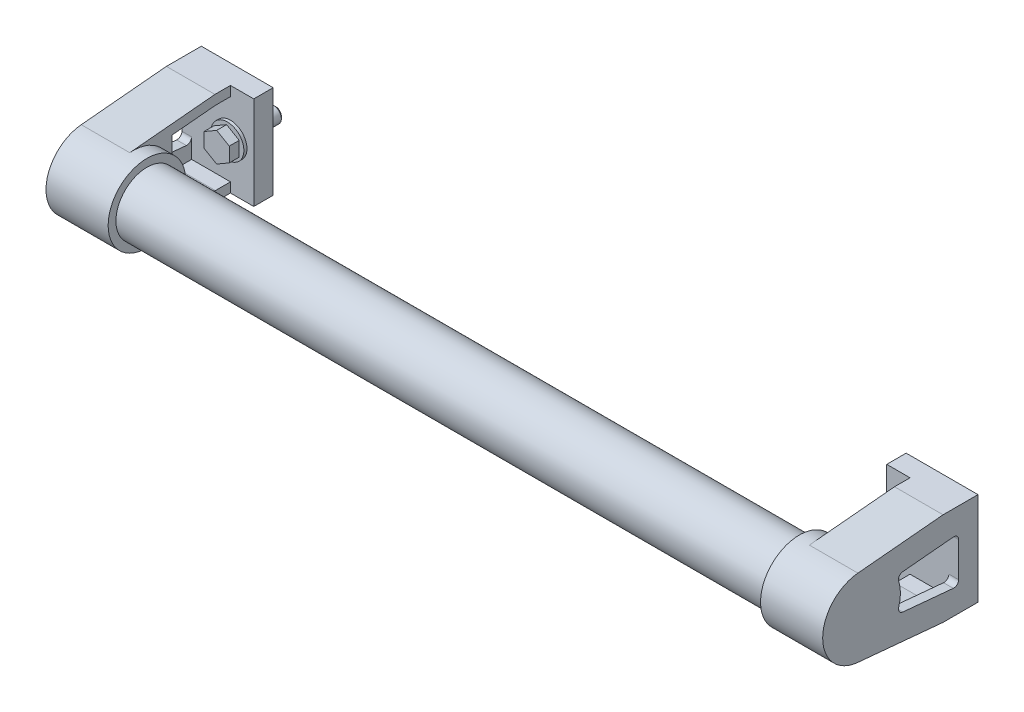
ISO-10303-21;
HEADER;
FILE_DESCRIPTION(('STEP AP214'),'2;1');
FILE_NAME('part.step','',(''),(''),'','','');
FILE_SCHEMA(('AUTOMOTIVE_DESIGN { 1 0 10303 214 1 1 1 1 }'));
ENDSEC;
DATA;
#1=APPLICATION_CONTEXT('core data for automotive mechanical design processes');
#2=APPLICATION_PROTOCOL_DEFINITION('international standard','automotive_design',2000,#1);
#3=PRODUCT_CONTEXT('',#1,'mechanical');
#4=PRODUCT('Part','Part','',(#3));
#5=PRODUCT_RELATED_PRODUCT_CATEGORY('part','',(#4));
#6=PRODUCT_DEFINITION_FORMATION('','',#4);
#7=PRODUCT_DEFINITION_CONTEXT('part definition',#1,'design');
#8=PRODUCT_DEFINITION('design','',#6,#7);
#9=PRODUCT_DEFINITION_SHAPE('','',#8);
#10=(LENGTH_UNIT() NAMED_UNIT(*) SI_UNIT(.MILLI.,.METRE.));
#11=(NAMED_UNIT(*) PLANE_ANGLE_UNIT() SI_UNIT($,.RADIAN.));
#12=(NAMED_UNIT(*) SI_UNIT($,.STERADIAN.) SOLID_ANGLE_UNIT());
#13=UNCERTAINTY_MEASURE_WITH_UNIT(LENGTH_MEASURE(1.E-05),#10,'distance_accuracy_value','');
#14=(GEOMETRIC_REPRESENTATION_CONTEXT(3) GLOBAL_UNCERTAINTY_ASSIGNED_CONTEXT((#13)) GLOBAL_UNIT_ASSIGNED_CONTEXT((#10,
#11,#12)) REPRESENTATION_CONTEXT('',''));
#15=CARTESIAN_POINT('',(0.,0.,0.));
#16=DIRECTION('',(0.,0.,1.));
#17=DIRECTION('',(1.,0.,0.));
#18=AXIS2_PLACEMENT_3D('',#15,#16,#17);
#19=CARTESIAN_POINT('',(16.,-23.9999999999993,18.0000000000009));
#20=DIRECTION('',(0.,0.995687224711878,-0.0927736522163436));
#21=DIRECTION('',(0.,0.0927736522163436,0.995687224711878));
#22=AXIS2_PLACEMENT_3D('',#19,#20,#21);
#23=PLANE('',#22);
#24=DIRECTION('',(0.,0.0927736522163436,0.995687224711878));
#25=VECTOR('',#24,1.);
#26=CARTESIAN_POINT('',(0.,-23.9999999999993,18.0000000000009));
#27=LINE('',#26,#25);
#28=CARTESIAN_POINT('',(0.,-19.9137444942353,61.8554730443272));
#29=VERTEX_POINT('',#28);
#30=CARTESIAN_POINT('',(0.,-23.9999999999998,17.999999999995));
#31=VERTEX_POINT('',#30);
#32=EDGE_CURVE('E651',#29,#31,#27,.F.);
#33=ORIENTED_EDGE('',*,*,#32,.F.);
#34=DIRECTION('',(-1.,0.,0.));
#35=VECTOR('',#34,1.);
#36=CARTESIAN_POINT('',(7.,-19.9137444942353,61.8554730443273));
#37=LINE('',#36,#35);
#38=CARTESIAN_POINT('',(-25.,-19.9137444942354,61.8554730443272));
#39=VERTEX_POINT('',#38);
#40=EDGE_CURVE('E587',#39,#29,#37,.F.);
#41=ORIENTED_EDGE('',*,*,#40,.F.);
#42=DIRECTION('',(0.,0.0927736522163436,0.995687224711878));
#43=VECTOR('',#42,1.);
#44=CARTESIAN_POINT('',(-25.,-23.9999999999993,18.0000000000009));
#45=LINE('',#44,#43);
#46=CARTESIAN_POINT('',(-25.,-24.,17.999999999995));
#47=VERTEX_POINT('',#46);
#48=EDGE_CURVE('E590',#47,#39,#45,.T.);
#49=ORIENTED_EDGE('',*,*,#48,.F.);
#50=DIRECTION('',(1.,0.,0.));
#51=VECTOR('',#50,1.);
#52=CARTESIAN_POINT('',(16.,-24.,17.999999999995));
#53=LINE('',#52,#51);
#54=EDGE_CURVE('E641',#31,#47,#53,.F.);
#55=ORIENTED_EDGE('',*,*,#54,.F.);
#56=EDGE_LOOP('',(#33,#41,#49,#55));
#57=FACE_BOUND('',#56,.T.);
#58=ADVANCED_FACE('F14',(#57),#23,.F.);
#59=CARTESIAN_POINT('',(16.,24.0000000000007,17.999999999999));
#60=DIRECTION('',(0.,0.995687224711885,0.092773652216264));
#61=DIRECTION('',(0.,-0.092773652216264,0.995687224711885));
#62=AXIS2_PLACEMENT_3D('',#59,#60,#61);
#63=PLANE('',#62);
#64=DIRECTION('',(1.,0.,0.));
#65=VECTOR('',#64,1.);
#66=CARTESIAN_POINT('',(16.,19.9137444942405,61.8554730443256));
#67=LINE('',#66,#65);
#68=CARTESIAN_POINT('',(-25.,19.9137444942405,61.8554730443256));
#69=VERTEX_POINT('',#68);
#70=CARTESIAN_POINT('',(0.,19.9137444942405,61.8554730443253));
#71=VERTEX_POINT('',#70);
#72=EDGE_CURVE('E582',#69,#71,#67,.T.);
#73=ORIENTED_EDGE('',*,*,#72,.T.);
#74=DIRECTION('',(0.,-0.092773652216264,0.995687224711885));
#75=VECTOR('',#74,1.);
#76=CARTESIAN_POINT('',(0.,24.0000000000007,17.999999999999));
#77=LINE('',#76,#75);
#78=CARTESIAN_POINT('',(0.,24.0000000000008,17.999999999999));
#79=VERTEX_POINT('',#78);
#80=EDGE_CURVE('E619',#71,#79,#77,.F.);
#81=ORIENTED_EDGE('',*,*,#80,.T.);
#82=DIRECTION('',(1.,0.,0.));
#83=VECTOR('',#82,1.);
#84=CARTESIAN_POINT('',(16.,24.0000000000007,17.999999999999));
#85=LINE('',#84,#83);
#86=CARTESIAN_POINT('',(-25.,24.0000000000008,17.999999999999));
#87=VERTEX_POINT('',#86);
#88=EDGE_CURVE('E593',#79,#87,#85,.F.);
#89=ORIENTED_EDGE('',*,*,#88,.T.);
#90=DIRECTION('',(0.,-0.092773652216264,0.995687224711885));
#91=VECTOR('',#90,1.);
#92=CARTESIAN_POINT('',(-25.,24.0000000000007,17.999999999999));
#93=LINE('',#92,#91);
#94=EDGE_CURVE('E586',#87,#69,#93,.T.);
#95=ORIENTED_EDGE('',*,*,#94,.T.);
#96=EDGE_LOOP('',(#73,#81,#89,#95));
#97=FACE_BOUND('',#96,.T.);
#98=ADVANCED_FACE('F1416',(#97),#63,.T.);
#99=CARTESIAN_POINT('',(7.,2.62290189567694E-12,60.));
#100=DIRECTION('',(-1.,0.,0.));
#101=DIRECTION('',(0.,0.,1.));
#102=AXIS2_PLACEMENT_3D('',#99,#100,#101);
#103=PLANE('',#102);
#104=CARTESIAN_POINT('',(7.,2.62463661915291E-12,60.));
#105=DIRECTION('',(1.,0.,0.));
#106=DIRECTION('',(0.,0.,-1.));
#107=AXIS2_PLACEMENT_3D('',#104,#105,#106);
#108=CIRCLE('',#107,16.);
#109=CARTESIAN_POINT('',(7.,2.62463661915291E-12,44.));
#110=VERTEX_POINT('',#109);
#111=EDGE_CURVE('E9',#110,#110,#108,.T.);
#112=ORIENTED_EDGE('',*,*,#111,.F.);
#113=EDGE_LOOP('',(#112));
#114=FACE_BOUND('',#113,.T.);
#115=CARTESIAN_POINT('',(7.,2.62290189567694E-12,60.));
#116=DIRECTION('',(-1.,0.,0.));
#117=DIRECTION('',(0.,0.,1.));
#118=AXIS2_PLACEMENT_3D('',#115,#116,#117);
#119=CIRCLE('',#118,20.0000000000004);
#120=CARTESIAN_POINT('',(7.,2.62290189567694E-12,80.0000000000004));
#121=VERTEX_POINT('',#120);
#122=EDGE_CURVE('E585',#121,#121,#119,.T.);
#123=ORIENTED_EDGE('',*,*,#122,.F.);
#124=EDGE_LOOP('',(#123));
#125=FACE_BOUND('',#124,.T.);
#126=ADVANCED_FACE('F1426',(#114,#125),#103,.F.);
#127=CARTESIAN_POINT('',(-6.5,4.9960036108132E-13,12.));
#128=DIRECTION('',(0.,0.,-1.));
#129=DIRECTION('',(0.,1.,0.));
#130=AXIS2_PLACEMENT_3D('',#127,#128,#129);
#131=PLANE('',#130);
#132=CARTESIAN_POINT('',(0.,4.99600361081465E-13,12.));
#133=DIRECTION('',(0.,0.,1.));
#134=DIRECTION('',(0.,-1.,0.));
#135=AXIS2_PLACEMENT_3D('',#132,#133,#134);
#136=CIRCLE('',#135,5.85000000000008);
#137=CARTESIAN_POINT('',(0.,-5.84999999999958,12.0000000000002));
#138=VERTEX_POINT('',#137);
#139=EDGE_CURVE('E566',#138,#138,#136,.F.);
#140=ORIENTED_EDGE('',*,*,#139,.F.);
#141=EDGE_LOOP('',(#140));
#142=FACE_BOUND('',#141,.T.);
#143=DIRECTION('',(0.866025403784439,0.5,0.));
#144=VECTOR('',#143,1.);
#145=CARTESIAN_POINT('',(0.,-7.50555349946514,12.));
#146=LINE('',#145,#144);
#147=CARTESIAN_POINT('',(0.,-7.50555349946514,12.));
#148=VERTEX_POINT('',#147);
#149=CARTESIAN_POINT('',(6.5,-3.75277674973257,12.));
#150=VERTEX_POINT('',#149);
#151=EDGE_CURVE('E1953',#148,#150,#146,.T.);
#152=ORIENTED_EDGE('',*,*,#151,.F.);
#153=DIRECTION('',(0.866025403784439,-0.5,0.));
#154=VECTOR('',#153,1.);
#155=CARTESIAN_POINT('',(-6.5,-3.75277674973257,12.));
#156=LINE('',#155,#154);
#157=CARTESIAN_POINT('',(-6.5,-3.75277674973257,12.));
#158=VERTEX_POINT('',#157);
#159=EDGE_CURVE('E1946',#158,#148,#156,.T.);
#160=ORIENTED_EDGE('',*,*,#159,.F.);
#161=DIRECTION('',(0.,-1.,0.));
#162=VECTOR('',#161,1.);
#163=CARTESIAN_POINT('',(-6.5,3.75277674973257,12.));
#164=LINE('',#163,#162);
#165=CARTESIAN_POINT('',(-6.5,3.75277674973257,12.));
#166=VERTEX_POINT('',#165);
#167=EDGE_CURVE('E1954',#166,#158,#164,.T.);
#168=ORIENTED_EDGE('',*,*,#167,.F.);
#169=DIRECTION('',(-0.866025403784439,-0.5,0.));
#170=VECTOR('',#169,1.);
#171=CARTESIAN_POINT('',(0.,7.50555349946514,12.));
#172=LINE('',#171,#170);
#173=CARTESIAN_POINT('',(0.,7.50555349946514,12.));
#174=VERTEX_POINT('',#173);
#175=EDGE_CURVE('E1959',#174,#166,#172,.T.);
#176=ORIENTED_EDGE('',*,*,#175,.F.);
#177=DIRECTION('',(-0.866025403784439,0.5,0.));
#178=VECTOR('',#177,1.);
#179=CARTESIAN_POINT('',(6.5,3.75277674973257,12.));
#180=LINE('',#179,#178);
#181=CARTESIAN_POINT('',(6.5,3.75277674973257,12.));
#182=VERTEX_POINT('',#181);
#183=EDGE_CURVE('E562',#182,#174,#180,.T.);
#184=ORIENTED_EDGE('',*,*,#183,.F.);
#185=DIRECTION('',(0.,1.,0.));
#186=VECTOR('',#185,1.);
#187=CARTESIAN_POINT('',(6.5,-3.75277674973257,12.));
#188=LINE('',#187,#186);
#189=EDGE_CURVE('E549',#150,#182,#188,.T.);
#190=ORIENTED_EDGE('',*,*,#189,.F.);
#191=EDGE_LOOP('',(#152,#160,#168,#176,#184,#190));
#192=FACE_BOUND('',#191,.T.);
#193=ADVANCED_FACE('F1692',(#142,#192),#131,.T.);
#194=CARTESIAN_POINT('',(0.,3.33066907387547E-12,80.));
#195=DIRECTION('',(0.,0.,1.));
#196=DIRECTION('',(0.,-1.,0.));
#197=AXIS2_PLACEMENT_3D('',#194,#195,#196);
#198=CYLINDRICAL_SURFACE('',#197,5.85000000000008);
#199=ORIENTED_EDGE('',*,*,#139,.T.);
#200=EDGE_LOOP('',(#199));
#201=FACE_BOUND('',#200,.T.);
#202=CARTESIAN_POINT('',(0.,4.82947015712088E-13,11.6));
#203=DIRECTION('',(0.,0.,1.));
#204=DIRECTION('',(0.,-1.,0.));
#205=AXIS2_PLACEMENT_3D('',#202,#203,#204);
#206=CIRCLE('',#205,5.85000000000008);
#207=CARTESIAN_POINT('',(0.,-5.8499999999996,11.6000000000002));
#208=VERTEX_POINT('',#207);
#209=EDGE_CURVE('E880',#208,#208,#206,.F.);
#210=ORIENTED_EDGE('',*,*,#209,.F.);
#211=EDGE_LOOP('',(#210));
#212=FACE_BOUND('',#211,.T.);
#213=ADVANCED_FACE('F1682',(#201,#212),#198,.T.);
#214=CARTESIAN_POINT('',(-5.85,4.71844785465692E-13,11.6));
#215=DIRECTION('',(0.,0.,1.));
#216=DIRECTION('',(0.,-1.,0.));
#217=AXIS2_PLACEMENT_3D('',#214,#215,#216);
#218=PLANE('',#217);
#219=CARTESIAN_POINT('',(0.,4.82947015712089E-13,11.6));
#220=DIRECTION('',(0.,0.,1.));
#221=DIRECTION('',(0.,-1.,0.));
#222=AXIS2_PLACEMENT_3D('',#219,#220,#221);
#223=CIRCLE('',#222,8.50000000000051);
#224=CARTESIAN_POINT('',(0.,-8.50000000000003,11.6000000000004));
#225=VERTEX_POINT('',#224);
#226=EDGE_CURVE('E827',#225,#225,#223,.F.);
#227=ORIENTED_EDGE('',*,*,#226,.F.);
#228=EDGE_LOOP('',(#227));
#229=FACE_BOUND('',#228,.T.);
#230=ORIENTED_EDGE('',*,*,#209,.T.);
#231=EDGE_LOOP('',(#230));
#232=FACE_BOUND('',#231,.T.);
#233=ADVANCED_FACE('F1672',(#229,#232),#218,.T.);
#234=CARTESIAN_POINT('',(0.,5.27355936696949E-13,12.7319341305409));
#235=DIRECTION('',(0.,0.,1.));
#236=DIRECTION('',(0.,-1.,0.));
#237=AXIS2_PLACEMENT_3D('',#234,#235,#236);
#238=CYLINDRICAL_SURFACE('',#237,3.99999999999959);
#239=CARTESIAN_POINT('',(0.,-5.10644337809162E-13,-12.2));
#240=DIRECTION('',(0.,0.,1.));
#241=DIRECTION('',(0.,-1.,0.));
#242=AXIS2_PLACEMENT_3D('',#239,#240,#241);
#243=CIRCLE('',#242,3.99999999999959);
#244=CARTESIAN_POINT('',(0.,-4.0000000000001,-12.1999999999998));
#245=VERTEX_POINT('',#244);
#246=EDGE_CURVE('E851',#245,#245,#243,.T.);
#247=ORIENTED_EDGE('',*,*,#246,.T.);
#248=EDGE_LOOP('',(#247));
#249=FACE_BOUND('',#248,.T.);
#250=CARTESIAN_POINT('',(0.,0.,0.));
#251=DIRECTION('',(0.,0.,1.));
#252=DIRECTION('',(0.,-1.,0.));
#253=AXIS2_PLACEMENT_3D('',#250,#251,#252);
#254=CIRCLE('',#253,3.99999999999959);
#255=CARTESIAN_POINT('',(0.,-3.99999999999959,1.1102230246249E-13));
#256=VERTEX_POINT('',#255);
#257=EDGE_CURVE('E722',#256,#256,#254,.T.);
#258=ORIENTED_EDGE('',*,*,#257,.F.);
#259=EDGE_LOOP('',(#258));
#260=FACE_BOUND('',#259,.T.);
#261=ADVANCED_FACE('F1662',(#249,#260),#238,.T.);
#262=CARTESIAN_POINT('',(0.,3.33066907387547E-12,80.));
#263=DIRECTION('',(0.,0.,1.));
#264=DIRECTION('',(0.,-1.,0.));
#265=AXIS2_PLACEMENT_3D('',#262,#263,#264);
#266=CYLINDRICAL_SURFACE('',#265,8.50000000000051);
#267=ORIENTED_EDGE('',*,*,#226,.T.);
#268=EDGE_LOOP('',(#267));
#269=FACE_BOUND('',#268,.T.);
#270=CARTESIAN_POINT('',(0.,4.16333634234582E-13,10.));
#271=DIRECTION('',(0.,0.,1.));
#272=DIRECTION('',(0.,-1.,0.));
#273=AXIS2_PLACEMENT_3D('',#270,#271,#272);
#274=CIRCLE('',#273,8.50000000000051);
#275=CARTESIAN_POINT('',(0.,-8.50000000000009,10.0000000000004));
#276=VERTEX_POINT('',#275);
#277=EDGE_CURVE('E688',#276,#276,#274,.T.);
#278=ORIENTED_EDGE('',*,*,#277,.T.);
#279=EDGE_LOOP('',(#278));
#280=FACE_BOUND('',#279,.T.);
#281=ADVANCED_FACE('F1652',(#269,#280),#266,.T.);
#282=CARTESIAN_POINT('',(-20.,-18.9999999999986,40.0000000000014));
#283=DIRECTION('',(1.,0.,0.));
#284=DIRECTION('',(0.,0.,-1.));
#285=AXIS2_PLACEMENT_3D('',#282,#283,#284);
#286=PLANE('',#285);
#287=DIRECTION('',(0.,1.,0.));
#288=VECTOR('',#287,1.);
#289=CARTESIAN_POINT('',(-20.,-23.9999999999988,40.0000000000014));
#290=LINE('',#289,#288);
#291=CARTESIAN_POINT('',(-20.,-16.9284817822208,40.0000000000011));
#292=VERTEX_POINT('',#291);
#293=CARTESIAN_POINT('',(-20.,-8.50076165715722,40.0000000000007));
#294=VERTEX_POINT('',#293);
#295=EDGE_CURVE('E792',#292,#294,#290,.T.);
#296=ORIENTED_EDGE('',*,*,#295,.F.);
#297=DIRECTION('',(0.,-0.0927736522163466,-0.995687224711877));
#298=VECTOR('',#297,1.);
#299=CARTESIAN_POINT('',(-20.,-18.9999999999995,17.7675646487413));
#300=LINE('',#299,#298);
#301=CARTESIAN_POINT('',(-20.,-18.9999999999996,17.7675646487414));
#302=VERTEX_POINT('',#301);
#303=EDGE_CURVE('E802',#292,#302,#300,.T.);
#304=ORIENTED_EDGE('',*,*,#303,.T.);
#305=DIRECTION('',(0.,0.,-1.));
#306=VECTOR('',#305,1.);
#307=CARTESIAN_POINT('',(-20.,-19.,10.0000000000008));
#308=LINE('',#307,#306);
#309=CARTESIAN_POINT('',(-20.,-19.,10.0000000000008));
#310=VERTEX_POINT('',#309);
#311=EDGE_CURVE('E824',#302,#310,#308,.T.);
#312=ORIENTED_EDGE('',*,*,#311,.T.);
#313=DIRECTION('',(0.,1.,0.));
#314=VECTOR('',#313,1.);
#315=CARTESIAN_POINT('',(-20.,-8.94532766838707,10.0000000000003));
#316=LINE('',#315,#314);
#317=CARTESIAN_POINT('',(-20.,-8.94532766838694,10.0000000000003));
#318=VERTEX_POINT('',#317);
#319=EDGE_CURVE('E682',#310,#318,#316,.T.);
#320=ORIENTED_EDGE('',*,*,#319,.T.);
#321=CARTESIAN_POINT('',(-20.,-8.94532766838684,12.5000000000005));
#322=DIRECTION('',(-1.,0.,0.));
#323=DIRECTION('',(0.,0.,1.));
#324=AXIS2_PLACEMENT_3D('',#321,#322,#323);
#325=CIRCLE('',#324,2.5);
#326=CARTESIAN_POINT('',(-20.,-11.4345457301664,12.7319341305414));
#327=VERTEX_POINT('',#326);
#328=EDGE_CURVE('E689',#318,#327,#325,.T.);
#329=ORIENTED_EDGE('',*,*,#328,.T.);
#330=DIRECTION('',(0.,0.0927736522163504,0.995687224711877));
#331=VECTOR('',#330,1.);
#332=CARTESIAN_POINT('',(-20.,-11.4345457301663,12.7319341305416));
#333=LINE('',#332,#331);
#334=CARTESIAN_POINT('',(-20.,-9.01504355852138,38.6990847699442));
#335=VERTEX_POINT('',#334);
#336=EDGE_CURVE('E693',#335,#327,#333,.F.);
#337=ORIENTED_EDGE('',*,*,#336,.F.);
#338=CARTESIAN_POINT('',(-20.,-6.52582549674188,38.4671506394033));
#339=DIRECTION('',(-1.,0.,0.));
#340=DIRECTION('',(0.,0.,1.));
#341=AXIS2_PLACEMENT_3D('',#338,#339,#340);
#342=CIRCLE('',#341,2.5);
#343=EDGE_CURVE('E698',#335,#294,#342,.T.);
#344=ORIENTED_EDGE('',*,*,#343,.T.);
#345=EDGE_LOOP('',(#296,#304,#312,#320,#329,#337,#344));
#346=FACE_BOUND('',#345,.T.);
#347=ADVANCED_FACE('F1642',(#346),#286,.T.);
#348=CARTESIAN_POINT('',(-20.,-18.9999999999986,40.0000000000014));
#349=DIRECTION('',(1.,0.,0.));
#350=DIRECTION('',(0.,0.,-1.));
#351=AXIS2_PLACEMENT_3D('',#348,#349,#350);
#352=PLANE('',#351);
#353=DIRECTION('',(0.,1.,0.));
#354=VECTOR('',#353,1.);
#355=CARTESIAN_POINT('',(-20.,-8.94532766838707,10.0000000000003));
#356=LINE('',#355,#354);
#357=CARTESIAN_POINT('',(-20.,8.94532766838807,9.99999999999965));
#358=VERTEX_POINT('',#357);
#359=CARTESIAN_POINT('',(-20.,19.0000000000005,9.99999999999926));
#360=VERTEX_POINT('',#359);
#361=EDGE_CURVE('E685',#358,#360,#356,.T.);
#362=ORIENTED_EDGE('',*,*,#361,.T.);
#363=DIRECTION('',(0.,0.,-1.));
#364=VECTOR('',#363,1.);
#365=CARTESIAN_POINT('',(-20.,19.0000000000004,9.99999999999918));
#366=LINE('',#365,#364);
#367=CARTESIAN_POINT('',(-20.,19.0000000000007,17.7675646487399));
#368=VERTEX_POINT('',#367);
#369=EDGE_CURVE('E760',#368,#360,#366,.T.);
#370=ORIENTED_EDGE('',*,*,#369,.F.);
#371=DIRECTION('',(0.,0.0927736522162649,-0.995687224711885));
#372=VECTOR('',#371,1.);
#373=CARTESIAN_POINT('',(-20.,19.0000000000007,17.7675646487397));
#374=LINE('',#373,#372);
#375=CARTESIAN_POINT('',(-20.,16.9284817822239,40.));
#376=VERTEX_POINT('',#375);
#377=EDGE_CURVE('E761',#376,#368,#374,.T.);
#378=ORIENTED_EDGE('',*,*,#377,.F.);
#379=DIRECTION('',(0.,1.,0.));
#380=VECTOR('',#379,1.);
#381=CARTESIAN_POINT('',(-20.,-23.9999999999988,40.0000000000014));
#382=LINE('',#381,#380);
#383=CARTESIAN_POINT('',(-20.,8.50076165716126,40.));
#384=VERTEX_POINT('',#383);
#385=EDGE_CURVE('E771',#384,#376,#382,.T.);
#386=ORIENTED_EDGE('',*,*,#385,.F.);
#387=CARTESIAN_POINT('',(-20.,6.52582549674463,38.4671506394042));
#388=DIRECTION('',(-1.,0.,0.));
#389=DIRECTION('',(0.,0.,1.));
#390=AXIS2_PLACEMENT_3D('',#387,#388,#389);
#391=CIRCLE('',#390,2.5);
#392=CARTESIAN_POINT('',(-20.,9.01504355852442,38.699084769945));
#393=VERTEX_POINT('',#392);
#394=EDGE_CURVE('E699',#384,#393,#391,.T.);
#395=ORIENTED_EDGE('',*,*,#394,.T.);
#396=DIRECTION('',(0.,-0.0927736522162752,0.995687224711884));
#397=VECTOR('',#396,1.);
#398=CARTESIAN_POINT('',(-20.,11.4345457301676,12.7319341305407));
#399=LINE('',#398,#397);
#400=CARTESIAN_POINT('',(-20.,11.4345457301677,12.7319341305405));
#401=VERTEX_POINT('',#400);
#402=EDGE_CURVE('E703',#393,#401,#399,.F.);
#403=ORIENTED_EDGE('',*,*,#402,.T.);
#404=CARTESIAN_POINT('',(-20.,8.94532766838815,12.4999999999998));
#405=DIRECTION('',(-1.,0.,0.));
#406=DIRECTION('',(0.,0.,1.));
#407=AXIS2_PLACEMENT_3D('',#404,#405,#406);
#408=CIRCLE('',#407,2.5);
#409=EDGE_CURVE('E721',#401,#358,#408,.T.);
#410=ORIENTED_EDGE('',*,*,#409,.T.);
#411=EDGE_LOOP('',(#362,#370,#378,#386,#395,#403,#410));
#412=FACE_BOUND('',#411,.T.);
#413=ADVANCED_FACE('F1632',(#412),#352,.T.);
#414=CARTESIAN_POINT('',(-11.,-19.,10.0000000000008));
#415=DIRECTION('',(0.,-1.,0.));
#416=DIRECTION('',(0.,0.,-1.));
#417=AXIS2_PLACEMENT_3D('',#414,#415,#416);
#418=PLANE('',#417);
#419=ORIENTED_EDGE('',*,*,#311,.F.);
#420=DIRECTION('',(1.,0.,0.));
#421=VECTOR('',#420,1.);
#422=CARTESIAN_POINT('',(-11.,-18.9999999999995,17.7675646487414));
#423=LINE('',#422,#421);
#424=CARTESIAN_POINT('',(0.,-19.,17.7675646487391));
#425=VERTEX_POINT('',#424);
#426=EDGE_CURVE('E793',#302,#425,#423,.T.);
#427=ORIENTED_EDGE('',*,*,#426,.T.);
#428=DIRECTION('',(0.,0.,-1.));
#429=VECTOR('',#428,1.);
#430=CARTESIAN_POINT('',(0.,-19.,38.4671506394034));
#431=LINE('',#430,#429);
#432=CARTESIAN_POINT('',(0.,-19.,10.0000000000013));
#433=VERTEX_POINT('',#432);
#434=EDGE_CURVE('E776',#433,#425,#431,.F.);
#435=ORIENTED_EDGE('',*,*,#434,.F.);
#436=DIRECTION('',(1.,0.,0.));
#437=VECTOR('',#436,1.);
#438=CARTESIAN_POINT('',(16.,-19.,10.0000000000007));
#439=LINE('',#438,#437);
#440=EDGE_CURVE('E736',#433,#310,#439,.F.);
#441=ORIENTED_EDGE('',*,*,#440,.T.);
#442=EDGE_LOOP('',(#419,#427,#435,#441));
#443=FACE_BOUND('',#442,.T.);
#444=ADVANCED_FACE('F1622',(#443),#418,.F.);
#445=CARTESIAN_POINT('',(-11.,-18.9999999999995,17.7675646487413));
#446=DIRECTION('',(0.,-0.995687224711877,0.0927736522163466));
#447=DIRECTION('',(0.,-0.0927736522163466,-0.995687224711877));
#448=AXIS2_PLACEMENT_3D('',#445,#446,#447);
#449=PLANE('',#448);
#450=ORIENTED_EDGE('',*,*,#303,.F.);
#451=DIRECTION('',(1.,0.,0.));
#452=VECTOR('',#451,1.);
#453=CARTESIAN_POINT('',(3.99999999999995,-16.9284817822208,40.0000000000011));
#454=LINE('',#453,#452);
#455=CARTESIAN_POINT('',(0.,-16.9284817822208,40.0000000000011));
#456=VERTEX_POINT('',#455);
#457=EDGE_CURVE('E789',#456,#292,#454,.F.);
#458=ORIENTED_EDGE('',*,*,#457,.F.);
#459=DIRECTION('',(0.,0.0927736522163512,0.995687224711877));
#460=VECTOR('',#459,1.);
#461=CARTESIAN_POINT('',(0.,-18.9999999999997,17.7675646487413));
#462=LINE('',#461,#460);
#463=EDGE_CURVE('E669',#425,#456,#462,.T.);
#464=ORIENTED_EDGE('',*,*,#463,.F.);
#465=ORIENTED_EDGE('',*,*,#426,.F.);
#466=EDGE_LOOP('',(#450,#458,#464,#465));
#467=FACE_BOUND('',#466,.T.);
#468=ADVANCED_FACE('F1612',(#467),#449,.F.);
#469=CARTESIAN_POINT('',(3.99999999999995,-23.9999999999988,40.0000000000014));
#470=DIRECTION('',(0.,0.,-1.));
#471=DIRECTION('',(0.,1.,0.));
#472=AXIS2_PLACEMENT_3D('',#469,#470,#471);
#473=PLANE('',#472);
#474=ORIENTED_EDGE('',*,*,#457,.T.);
#475=ORIENTED_EDGE('',*,*,#295,.T.);
#476=DIRECTION('',(-1.,0.,0.));
#477=VECTOR('',#476,1.);
#478=CARTESIAN_POINT('',(16.,-8.50076165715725,40.0000000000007));
#479=LINE('',#478,#477);
#480=CARTESIAN_POINT('',(0.,-8.50076165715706,40.0000000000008));
#481=VERTEX_POINT('',#480);
#482=EDGE_CURVE('E694',#294,#481,#479,.F.);
#483=ORIENTED_EDGE('',*,*,#482,.T.);
#484=DIRECTION('',(0.,1.,0.));
#485=VECTOR('',#484,1.);
#486=CARTESIAN_POINT('',(0.,-6.52582549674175,40.0000000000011));
#487=LINE('',#486,#485);
#488=EDGE_CURVE('E665',#456,#481,#487,.T.);
#489=ORIENTED_EDGE('',*,*,#488,.F.);
#490=EDGE_LOOP('',(#474,#475,#483,#489));
#491=FACE_BOUND('',#490,.T.);
#492=ADVANCED_FACE('F1602',(#491),#473,.T.);
#493=CARTESIAN_POINT('',(3.99999999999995,-23.9999999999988,40.0000000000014));
#494=DIRECTION('',(0.,0.,-1.));
#495=DIRECTION('',(0.,1.,0.));
#496=AXIS2_PLACEMENT_3D('',#493,#494,#495);
#497=PLANE('',#496);
#498=DIRECTION('',(-1.,0.,0.));
#499=VECTOR('',#498,1.);
#500=CARTESIAN_POINT('',(16.,8.50076165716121,40.));
#501=LINE('',#500,#499);
#502=CARTESIAN_POINT('',(0.,8.50076165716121,40.));
#503=VERTEX_POINT('',#502);
#504=EDGE_CURVE('E702',#503,#384,#501,.T.);
#505=ORIENTED_EDGE('',*,*,#504,.T.);
#506=ORIENTED_EDGE('',*,*,#385,.T.);
#507=DIRECTION('',(1.,0.,0.));
#508=VECTOR('',#507,1.);
#509=CARTESIAN_POINT('',(-11.,16.9284817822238,40.));
#510=LINE('',#509,#508);
#511=CARTESIAN_POINT('',(0.,16.9284817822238,40.));
#512=VERTEX_POINT('',#511);
#513=EDGE_CURVE('E768',#512,#376,#510,.F.);
#514=ORIENTED_EDGE('',*,*,#513,.F.);
#515=DIRECTION('',(0.,1.,0.));
#516=VECTOR('',#515,1.);
#517=CARTESIAN_POINT('',(0.,2.62290189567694E-12,40.));
#518=LINE('',#517,#516);
#519=EDGE_CURVE('E633',#503,#512,#518,.T.);
#520=ORIENTED_EDGE('',*,*,#519,.F.);
#521=EDGE_LOOP('',(#505,#506,#514,#520));
#522=FACE_BOUND('',#521,.T.);
#523=ADVANCED_FACE('F1592',(#522),#497,.T.);
#524=CARTESIAN_POINT('',(-11.,19.0000000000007,17.7675646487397));
#525=DIRECTION('',(0.,-0.995687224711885,-0.0927736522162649));
#526=DIRECTION('',(0.,0.0927736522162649,-0.995687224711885));
#527=AXIS2_PLACEMENT_3D('',#524,#525,#526);
#528=PLANE('',#527);
#529=DIRECTION('',(1.,0.,0.));
#530=VECTOR('',#529,1.);
#531=CARTESIAN_POINT('',(-11.,19.0000000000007,17.7675646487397));
#532=LINE('',#531,#530);
#533=CARTESIAN_POINT('',(0.,19.0000000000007,17.7675646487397));
#534=VERTEX_POINT('',#533);
#535=EDGE_CURVE('E757',#534,#368,#532,.F.);
#536=ORIENTED_EDGE('',*,*,#535,.F.);
#537=DIRECTION('',(0.,0.0927736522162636,-0.995687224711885));
#538=VECTOR('',#537,1.);
#539=CARTESIAN_POINT('',(0.,16.9284817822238,40.));
#540=LINE('',#539,#538);
#541=EDGE_CURVE('E636',#512,#534,#540,.T.);
#542=ORIENTED_EDGE('',*,*,#541,.F.);
#543=ORIENTED_EDGE('',*,*,#513,.T.);
#544=ORIENTED_EDGE('',*,*,#377,.T.);
#545=EDGE_LOOP('',(#536,#542,#543,#544));
#546=FACE_BOUND('',#545,.T.);
#547=ADVANCED_FACE('F1582',(#546),#528,.T.);
#548=CARTESIAN_POINT('',(-11.,19.0000000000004,9.99999999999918));
#549=DIRECTION('',(0.,-1.,0.));
#550=DIRECTION('',(0.,0.,-1.));
#551=AXIS2_PLACEMENT_3D('',#548,#549,#550);
#552=PLANE('',#551);
#553=DIRECTION('',(1.,0.,0.));
#554=VECTOR('',#553,1.);
#555=CARTESIAN_POINT('',(16.,19.0000000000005,9.99999999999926));
#556=LINE('',#555,#554);
#557=CARTESIAN_POINT('',(0.,19.0000000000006,9.99999999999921));
#558=VERTEX_POINT('',#557);
#559=EDGE_CURVE('E747',#360,#558,#556,.T.);
#560=ORIENTED_EDGE('',*,*,#559,.T.);
#561=DIRECTION('',(0.,0.,-1.));
#562=VECTOR('',#561,1.);
#563=CARTESIAN_POINT('',(0.,19.0000000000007,60.));
#564=LINE('',#563,#562);
#565=EDGE_CURVE('E742',#534,#558,#564,.T.);
#566=ORIENTED_EDGE('',*,*,#565,.F.);
#567=ORIENTED_EDGE('',*,*,#535,.T.);
#568=ORIENTED_EDGE('',*,*,#369,.T.);
#569=EDGE_LOOP('',(#560,#566,#567,#568));
#570=FACE_BOUND('',#569,.T.);
#571=ADVANCED_FACE('F1572',(#570),#552,.T.);
#572=CARTESIAN_POINT('',(12.,-24.,10.0000000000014));
#573=DIRECTION('',(1.,0.,0.));
#574=DIRECTION('',(0.,0.,-1.));
#575=AXIS2_PLACEMENT_3D('',#572,#573,#574);
#576=PLANE('',#575);
#577=DIRECTION('',(0.,1.,0.));
#578=VECTOR('',#577,1.);
#579=CARTESIAN_POINT('',(12.,-24.0000000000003,9.43689570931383E-13));
#580=LINE('',#579,#578);
#581=CARTESIAN_POINT('',(12.,24.,-1.0177044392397E-12));
#582=VERTEX_POINT('',#581);
#583=CARTESIAN_POINT('',(12.,-24.0000000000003,9.43689570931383E-13));
#584=VERTEX_POINT('',#583);
#585=EDGE_CURVE('E718',#582,#584,#580,.F.);
#586=ORIENTED_EDGE('',*,*,#585,.F.);
#587=DIRECTION('',(0.,0.,1.));
#588=VECTOR('',#587,1.);
#589=CARTESIAN_POINT('',(12.,24.,-1.0547118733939E-12));
#590=LINE('',#589,#588);
#591=CARTESIAN_POINT('',(12.,24.0000000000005,9.99999999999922));
#592=VERTEX_POINT('',#591);
#593=EDGE_CURVE('E706',#592,#582,#590,.F.);
#594=ORIENTED_EDGE('',*,*,#593,.F.);
#595=DIRECTION('',(0.,1.,0.));
#596=VECTOR('',#595,1.);
#597=CARTESIAN_POINT('',(12.,-8.94532766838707,10.0000000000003));
#598=LINE('',#597,#596);
#599=CARTESIAN_POINT('',(12.,-24.,10.0000000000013));
#600=VERTEX_POINT('',#599);
#601=EDGE_CURVE('E733',#592,#600,#598,.F.);
#602=ORIENTED_EDGE('',*,*,#601,.T.);
#603=DIRECTION('',(0.,0.,1.));
#604=VECTOR('',#603,1.);
#605=CARTESIAN_POINT('',(12.,-24.0000000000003,9.43689570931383E-13));
#606=LINE('',#605,#604);
#607=EDGE_CURVE('E715',#600,#584,#606,.F.);
#608=ORIENTED_EDGE('',*,*,#607,.T.);
#609=EDGE_LOOP('',(#586,#594,#602,#608));
#610=FACE_BOUND('',#609,.T.);
#611=ADVANCED_FACE('F1562',(#610),#576,.T.);
#612=CARTESIAN_POINT('',(16.,-24.0000000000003,9.43689570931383E-13));
#613=DIRECTION('',(0.,0.,-1.));
#614=DIRECTION('',(0.,1.,0.));
#615=AXIS2_PLACEMENT_3D('',#612,#613,#614);
#616=PLANE('',#615);
#617=DIRECTION('',(1.,0.,0.));
#618=VECTOR('',#617,1.);
#619=CARTESIAN_POINT('',(16.,-24.0000000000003,9.43689570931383E-13));
#620=LINE('',#619,#618);
#621=CARTESIAN_POINT('',(-25.,-24.0000000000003,-3.88578058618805E-13));
#622=VERTEX_POINT('',#621);
#623=EDGE_CURVE('E657',#584,#622,#620,.F.);
#624=ORIENTED_EDGE('',*,*,#623,.T.);
#625=DIRECTION('',(0.,1.,0.));
#626=VECTOR('',#625,1.);
#627=CARTESIAN_POINT('',(-25.,2.62290189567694E-12,-1.0547118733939E-12));
#628=LINE('',#627,#626);
#629=CARTESIAN_POINT('',(-25.,24.0000000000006,-1.0547118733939E-12));
#630=VERTEX_POINT('',#629);
#631=EDGE_CURVE('E613',#630,#622,#628,.F.);
#632=ORIENTED_EDGE('',*,*,#631,.F.);
#633=DIRECTION('',(1.,0.,0.));
#634=VECTOR('',#633,1.);
#635=CARTESIAN_POINT('',(16.,24.,-1.0547118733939E-12));
#636=LINE('',#635,#634);
#637=EDGE_CURVE('E646',#582,#630,#636,.F.);
#638=ORIENTED_EDGE('',*,*,#637,.F.);
#639=ORIENTED_EDGE('',*,*,#585,.T.);
#640=EDGE_LOOP('',(#624,#632,#638,#639));
#641=FACE_BOUND('',#640,.T.);
#642=ORIENTED_EDGE('',*,*,#257,.T.);
#643=EDGE_LOOP('',(#642));
#644=FACE_BOUND('',#643,.T.);
#645=ADVANCED_FACE('F1552',(#641,#644),#616,.T.);
#646=CARTESIAN_POINT('',(7.,8.94532766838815,12.4999999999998));
#647=DIRECTION('',(-1.,0.,0.));
#648=DIRECTION('',(0.,0.,1.));
#649=AXIS2_PLACEMENT_3D('',#646,#647,#648);
#650=CYLINDRICAL_SURFACE('',#649,2.5);
#651=DIRECTION('',(1.,0.,0.));
#652=VECTOR('',#651,1.);
#653=CARTESIAN_POINT('',(7.,11.4345457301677,12.7319341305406));
#654=LINE('',#653,#652);
#655=CARTESIAN_POINT('',(-25.,11.4345457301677,12.7319341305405));
#656=VERTEX_POINT('',#655);
#657=EDGE_CURVE('E700',#401,#656,#654,.F.);
#658=ORIENTED_EDGE('',*,*,#657,.T.);
#659=CARTESIAN_POINT('',(-25.,8.94532766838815,12.4999999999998));
#660=DIRECTION('',(-1.,0.,0.));
#661=DIRECTION('',(0.,0.,1.));
#662=AXIS2_PLACEMENT_3D('',#659,#660,#661);
#663=CIRCLE('',#662,2.5);
#664=CARTESIAN_POINT('',(-25.,8.94532766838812,10.));
#665=VERTEX_POINT('',#664);
#666=EDGE_CURVE('E609',#665,#656,#663,.F.);
#667=ORIENTED_EDGE('',*,*,#666,.F.);
#668=DIRECTION('',(1.,0.,0.));
#669=VECTOR('',#668,1.);
#670=CARTESIAN_POINT('',(16.,8.94532766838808,9.99999999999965));
#671=LINE('',#670,#669);
#672=EDGE_CURVE('E681',#665,#358,#671,.T.);
#673=ORIENTED_EDGE('',*,*,#672,.T.);
#674=ORIENTED_EDGE('',*,*,#409,.F.);
#675=EDGE_LOOP('',(#658,#667,#673,#674));
#676=FACE_BOUND('',#675,.T.);
#677=ADVANCED_FACE('F1542',(#676),#650,.F.);
#678=CARTESIAN_POINT('',(7.,11.4345457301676,12.7319341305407));
#679=DIRECTION('',(0.,0.995687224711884,0.0927736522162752));
#680=DIRECTION('',(0.,-0.0927736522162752,0.995687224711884));
#681=AXIS2_PLACEMENT_3D('',#678,#679,#680);
#682=PLANE('',#681);
#683=DIRECTION('',(0.,-0.0927736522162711,0.995687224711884));
#684=VECTOR('',#683,1.);
#685=CARTESIAN_POINT('',(-25.,11.4345457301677,12.7319341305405));
#686=LINE('',#685,#684);
#687=CARTESIAN_POINT('',(-25.,9.01504355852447,38.699084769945));
#688=VERTEX_POINT('',#687);
#689=EDGE_CURVE('E605',#656,#688,#686,.T.);
#690=ORIENTED_EDGE('',*,*,#689,.F.);
#691=ORIENTED_EDGE('',*,*,#657,.F.);
#692=ORIENTED_EDGE('',*,*,#402,.F.);
#693=DIRECTION('',(-1.,0.,0.));
#694=VECTOR('',#693,1.);
#695=CARTESIAN_POINT('',(16.,9.01504355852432,38.6990847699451));
#696=LINE('',#695,#694);
#697=EDGE_CURVE('E695',#393,#688,#696,.T.);
#698=ORIENTED_EDGE('',*,*,#697,.T.);
#699=EDGE_LOOP('',(#690,#691,#692,#698));
#700=FACE_BOUND('',#699,.T.);
#701=ADVANCED_FACE('F1532',(#700),#682,.F.);
#702=CARTESIAN_POINT('',(7.,-11.4345457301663,12.7319341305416));
#703=DIRECTION('',(0.,0.995687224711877,-0.0927736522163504));
#704=DIRECTION('',(0.,0.0927736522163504,0.995687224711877));
#705=AXIS2_PLACEMENT_3D('',#702,#703,#704);
#706=PLANE('',#705);
#707=DIRECTION('',(-1.,0.,0.));
#708=VECTOR('',#707,1.);
#709=CARTESIAN_POINT('',(7.,-11.4345457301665,12.7319341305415));
#710=LINE('',#709,#708);
#711=CARTESIAN_POINT('',(-25.,-11.4345457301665,12.7319341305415));
#712=VERTEX_POINT('',#711);
#713=EDGE_CURVE('E686',#327,#712,#710,.T.);
#714=ORIENTED_EDGE('',*,*,#713,.T.);
#715=DIRECTION('',(0.,-0.0927736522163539,-0.995687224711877));
#716=VECTOR('',#715,1.);
#717=CARTESIAN_POINT('',(-25.,-9.01504355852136,38.6990847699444));
#718=LINE('',#717,#716);
#719=CARTESIAN_POINT('',(-25.,-9.01504355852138,38.6990847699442));
#720=VERTEX_POINT('',#719);
#721=EDGE_CURVE('E601',#720,#712,#718,.T.);
#722=ORIENTED_EDGE('',*,*,#721,.F.);
#723=DIRECTION('',(1.,0.,0.));
#724=VECTOR('',#723,1.);
#725=CARTESIAN_POINT('',(7.,-9.01504355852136,38.6990847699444));
#726=LINE('',#725,#724);
#727=EDGE_CURVE('E690',#720,#335,#726,.T.);
#728=ORIENTED_EDGE('',*,*,#727,.T.);
#729=ORIENTED_EDGE('',*,*,#336,.T.);
#730=EDGE_LOOP('',(#714,#722,#728,#729));
#731=FACE_BOUND('',#730,.T.);
#732=ADVANCED_FACE('F1522',(#731),#706,.T.);
#733=CARTESIAN_POINT('',(7.,-8.94532766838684,12.5000000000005));
#734=DIRECTION('',(-1.,0.,0.));
#735=DIRECTION('',(0.,0.,1.));
#736=AXIS2_PLACEMENT_3D('',#733,#734,#735);
#737=CYLINDRICAL_SURFACE('',#736,2.5);
#738=CARTESIAN_POINT('',(-25.,-8.94532766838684,12.5000000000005));
#739=DIRECTION('',(-1.,0.,0.));
#740=DIRECTION('',(0.,0.,1.));
#741=AXIS2_PLACEMENT_3D('',#738,#739,#740);
#742=CIRCLE('',#741,2.5);
#743=CARTESIAN_POINT('',(-25.,-8.94532766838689,10.0000000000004));
#744=VERTEX_POINT('',#743);
#745=EDGE_CURVE('E600',#712,#744,#742,.F.);
#746=ORIENTED_EDGE('',*,*,#745,.F.);
#747=ORIENTED_EDGE('',*,*,#713,.F.);
#748=ORIENTED_EDGE('',*,*,#328,.F.);
#749=DIRECTION('',(1.,0.,0.));
#750=VECTOR('',#749,1.);
#751=CARTESIAN_POINT('',(16.,-8.94532766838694,10.0000000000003));
#752=LINE('',#751,#750);
#753=EDGE_CURVE('E679',#318,#744,#752,.F.);
#754=ORIENTED_EDGE('',*,*,#753,.T.);
#755=EDGE_LOOP('',(#746,#747,#748,#754));
#756=FACE_BOUND('',#755,.T.);
#757=ADVANCED_FACE('F1512',(#756),#737,.F.);
#758=CARTESIAN_POINT('',(16.,-8.94532766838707,10.0000000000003));
#759=DIRECTION('',(0.,0.,-1.));
#760=DIRECTION('',(0.,1.,0.));
#761=AXIS2_PLACEMENT_3D('',#758,#759,#760);
#762=PLANE('',#761);
#763=ORIENTED_EDGE('',*,*,#559,.F.);
#764=ORIENTED_EDGE('',*,*,#361,.F.);
#765=ORIENTED_EDGE('',*,*,#672,.F.);
#766=DIRECTION('',(0.,1.,0.));
#767=VECTOR('',#766,1.);
#768=CARTESIAN_POINT('',(-25.,2.62290189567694E-12,10.0000000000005));
#769=LINE('',#768,#767);
#770=EDGE_CURVE('E596',#744,#665,#769,.T.);
#771=ORIENTED_EDGE('',*,*,#770,.F.);
#772=ORIENTED_EDGE('',*,*,#753,.F.);
#773=ORIENTED_EDGE('',*,*,#319,.F.);
#774=ORIENTED_EDGE('',*,*,#440,.F.);
#775=DIRECTION('',(0.,1.,0.));
#776=VECTOR('',#775,1.);
#777=CARTESIAN_POINT('',(0.,-6.52582549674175,10.0000000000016));
#778=LINE('',#777,#776);
#779=CARTESIAN_POINT('',(0.,-24.,10.0000000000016));
#780=VERTEX_POINT('',#779);
#781=EDGE_CURVE('E750',#780,#433,#778,.T.);
#782=ORIENTED_EDGE('',*,*,#781,.F.);
#783=DIRECTION('',(1.,0.,0.));
#784=VECTOR('',#783,1.);
#785=CARTESIAN_POINT('',(16.,-24.,10.0000000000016));
#786=LINE('',#785,#784);
#787=EDGE_CURVE('E637',#780,#600,#786,.T.);
#788=ORIENTED_EDGE('',*,*,#787,.T.);
#789=ORIENTED_EDGE('',*,*,#601,.F.);
#790=DIRECTION('',(1.,0.,0.));
#791=VECTOR('',#790,1.);
#792=CARTESIAN_POINT('',(16.,24.0000000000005,9.9999999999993));
#793=LINE('',#792,#791);
#794=CARTESIAN_POINT('',(0.,24.0000000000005,9.99999999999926));
#795=VERTEX_POINT('',#794);
#796=EDGE_CURVE('E625',#795,#592,#793,.T.);
#797=ORIENTED_EDGE('',*,*,#796,.F.);
#798=DIRECTION('',(0.,1.,0.));
#799=VECTOR('',#798,1.);
#800=CARTESIAN_POINT('',(0.,2.62290189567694E-12,9.99999999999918));
#801=LINE('',#800,#799);
#802=EDGE_CURVE('E739',#558,#795,#801,.T.);
#803=ORIENTED_EDGE('',*,*,#802,.F.);
#804=EDGE_LOOP('',(#763,#764,#765,#771,#772,#773,#774,#782,#788,#789,#797,#803));
#805=FACE_BOUND('',#804,.T.);
#806=ORIENTED_EDGE('',*,*,#277,.F.);
#807=EDGE_LOOP('',(#806));
#808=FACE_BOUND('',#807,.T.);
#809=ADVANCED_FACE('F1502',(#805,#808),#762,.F.);
#810=CARTESIAN_POINT('',(16.,6.52582549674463,38.4671506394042));
#811=DIRECTION('',(-1.,0.,0.));
#812=DIRECTION('',(0.,0.,1.));
#813=AXIS2_PLACEMENT_3D('',#810,#811,#812);
#814=CYLINDRICAL_SURFACE('',#813,2.5);
#815=CARTESIAN_POINT('',(0.,6.52582549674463,38.4671506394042));
#816=DIRECTION('',(-1.,0.,0.));
#817=DIRECTION('',(0.,0.,1.));
#818=AXIS2_PLACEMENT_3D('',#815,#816,#817);
#819=CIRCLE('',#818,2.5);
#820=CARTESIAN_POINT('',(0.,5.80073377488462,40.8596894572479));
#821=VERTEX_POINT('',#820);
#822=EDGE_CURVE('E626',#821,#503,#819,.T.);
#823=ORIENTED_EDGE('',*,*,#822,.F.);
#824=DIRECTION('',(-1.,0.,0.));
#825=VECTOR('',#824,1.);
#826=CARTESIAN_POINT('',(7.,5.8007337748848,40.8596894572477));
#827=LINE('',#826,#825);
#828=CARTESIAN_POINT('',(-25.,5.80073377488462,40.8596894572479));
#829=VERTEX_POINT('',#828);
#830=EDGE_CURVE('E599',#829,#821,#827,.F.);
#831=ORIENTED_EDGE('',*,*,#830,.F.);
#832=CARTESIAN_POINT('',(-25.,6.52582549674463,38.4671506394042));
#833=DIRECTION('',(-1.,0.,0.));
#834=DIRECTION('',(0.,0.,1.));
#835=AXIS2_PLACEMENT_3D('',#832,#833,#834);
#836=CIRCLE('',#835,2.5);
#837=EDGE_CURVE('E608',#688,#829,#836,.F.);
#838=ORIENTED_EDGE('',*,*,#837,.F.);
#839=ORIENTED_EDGE('',*,*,#697,.F.);
#840=ORIENTED_EDGE('',*,*,#394,.F.);
#841=ORIENTED_EDGE('',*,*,#504,.F.);
#842=EDGE_LOOP('',(#823,#831,#838,#839,#840,#841));
#843=FACE_BOUND('',#842,.T.);
#844=ADVANCED_FACE('F1492',(#843),#814,.F.);
#845=CARTESIAN_POINT('',(16.,-6.52582549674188,38.4671506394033));
#846=DIRECTION('',(-1.,0.,0.));
#847=DIRECTION('',(0.,0.,1.));
#848=AXIS2_PLACEMENT_3D('',#845,#846,#847);
#849=CYLINDRICAL_SURFACE('',#848,2.5);
#850=CARTESIAN_POINT('',(0.,-6.52582549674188,38.4671506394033));
#851=DIRECTION('',(-1.,0.,0.));
#852=DIRECTION('',(0.,0.,1.));
#853=AXIS2_PLACEMENT_3D('',#850,#851,#852);
#854=CIRCLE('',#853,2.5);
#855=CARTESIAN_POINT('',(0.,-5.80073377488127,40.8596894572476));
#856=VERTEX_POINT('',#855);
#857=EDGE_CURVE('E668',#481,#856,#854,.T.);
#858=ORIENTED_EDGE('',*,*,#857,.F.);
#859=ORIENTED_EDGE('',*,*,#482,.F.);
#860=ORIENTED_EDGE('',*,*,#343,.F.);
#861=ORIENTED_EDGE('',*,*,#727,.F.);
#862=CARTESIAN_POINT('',(-25.,-6.52582549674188,38.4671506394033));
#863=DIRECTION('',(-1.,0.,0.));
#864=DIRECTION('',(0.,0.,1.));
#865=AXIS2_PLACEMENT_3D('',#862,#863,#864);
#866=CIRCLE('',#865,2.5);
#867=CARTESIAN_POINT('',(-25.,-5.80073377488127,40.8596894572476));
#868=VERTEX_POINT('',#867);
#869=EDGE_CURVE('E604',#868,#720,#866,.F.);
#870=ORIENTED_EDGE('',*,*,#869,.F.);
#871=DIRECTION('',(-1.,0.,0.));
#872=VECTOR('',#871,1.);
#873=CARTESIAN_POINT('',(7.,-5.80073377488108,40.8596894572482));
#874=LINE('',#873,#872);
#875=EDGE_CURVE('E672',#856,#868,#874,.T.);
#876=ORIENTED_EDGE('',*,*,#875,.F.);
#877=EDGE_LOOP('',(#858,#859,#860,#861,#870,#876));
#878=FACE_BOUND('',#877,.T.);
#879=ADVANCED_FACE('F1482',(#878),#849,.F.);
#880=CARTESIAN_POINT('',(0.,-6.52582549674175,38.4671506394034));
#881=DIRECTION('',(1.,0.,0.));
#882=DIRECTION('',(0.,0.,-1.));
#883=AXIS2_PLACEMENT_3D('',#880,#881,#882);
#884=PLANE('',#883);
#885=ORIENTED_EDGE('',*,*,#488,.T.);
#886=ORIENTED_EDGE('',*,*,#857,.T.);
#887=CARTESIAN_POINT('',(0.,2.62290189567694E-12,60.));
#888=DIRECTION('',(-1.,0.,0.));
#889=DIRECTION('',(0.,0.,1.));
#890=AXIS2_PLACEMENT_3D('',#887,#888,#889);
#891=CIRCLE('',#890,20.0000000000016);
#892=EDGE_CURVE('E675',#29,#856,#891,.F.);
#893=ORIENTED_EDGE('',*,*,#892,.F.);
#894=ORIENTED_EDGE('',*,*,#32,.T.);
#895=DIRECTION('',(0.,0.,1.));
#896=VECTOR('',#895,1.);
#897=CARTESIAN_POINT('',(0.,-24.0000000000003,9.43689570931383E-13));
#898=LINE('',#897,#896);
#899=EDGE_CURVE('E654',#31,#780,#898,.F.);
#900=ORIENTED_EDGE('',*,*,#899,.T.);
#901=ORIENTED_EDGE('',*,*,#781,.T.);
#902=ORIENTED_EDGE('',*,*,#434,.T.);
#903=ORIENTED_EDGE('',*,*,#463,.T.);
#904=EDGE_LOOP('',(#885,#886,#893,#894,#900,#901,#902,#903));
#905=FACE_BOUND('',#904,.T.);
#906=ADVANCED_FACE('F1472',(#905),#884,.T.);
#907=CARTESIAN_POINT('',(16.,-24.0000000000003,9.43689570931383E-13));
#908=DIRECTION('',(0.,1.,0.));
#909=DIRECTION('',(0.,0.,1.));
#910=AXIS2_PLACEMENT_3D('',#907,#908,#909);
#911=PLANE('',#910);
#912=ORIENTED_EDGE('',*,*,#899,.F.);
#913=ORIENTED_EDGE('',*,*,#54,.T.);
#914=DIRECTION('',(0.,0.,1.));
#915=VECTOR('',#914,1.);
#916=CARTESIAN_POINT('',(-25.,-24.0000000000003,60.));
#917=LINE('',#916,#915);
#918=EDGE_CURVE('E614',#622,#47,#917,.T.);
#919=ORIENTED_EDGE('',*,*,#918,.F.);
#920=ORIENTED_EDGE('',*,*,#623,.F.);
#921=ORIENTED_EDGE('',*,*,#607,.F.);
#922=ORIENTED_EDGE('',*,*,#787,.F.);
#923=EDGE_LOOP('',(#912,#913,#919,#920,#921,#922));
#924=FACE_BOUND('',#923,.T.);
#925=ADVANCED_FACE('F1462',(#924),#911,.F.);
#926=CARTESIAN_POINT('',(0.,2.62290189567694E-12,60.));
#927=DIRECTION('',(1.,0.,0.));
#928=DIRECTION('',(0.,0.,-1.));
#929=AXIS2_PLACEMENT_3D('',#926,#927,#928);
#930=PLANE('',#929);
#931=DIRECTION('',(0.,0.,1.));
#932=VECTOR('',#931,1.);
#933=CARTESIAN_POINT('',(0.,24.,-1.0547118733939E-12));
#934=LINE('',#933,#932);
#935=EDGE_CURVE('E622',#79,#795,#934,.F.);
#936=ORIENTED_EDGE('',*,*,#935,.F.);
#937=ORIENTED_EDGE('',*,*,#80,.F.);
#938=CARTESIAN_POINT('',(0.,2.62290189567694E-12,60.));
#939=DIRECTION('',(-1.,0.,0.));
#940=DIRECTION('',(0.,0.,1.));
#941=AXIS2_PLACEMENT_3D('',#938,#939,#940);
#942=CIRCLE('',#941,20.0000000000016);
#943=EDGE_CURVE('E678',#821,#71,#942,.F.);
#944=ORIENTED_EDGE('',*,*,#943,.F.);
#945=ORIENTED_EDGE('',*,*,#822,.T.);
#946=ORIENTED_EDGE('',*,*,#519,.T.);
#947=ORIENTED_EDGE('',*,*,#541,.T.);
#948=ORIENTED_EDGE('',*,*,#565,.T.);
#949=ORIENTED_EDGE('',*,*,#802,.T.);
#950=EDGE_LOOP('',(#936,#937,#944,#945,#946,#947,#948,#949));
#951=FACE_BOUND('',#950,.T.);
#952=ADVANCED_FACE('F1452',(#951),#930,.T.);
#953=CARTESIAN_POINT('',(16.,24.,-1.0547118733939E-12));
#954=DIRECTION('',(0.,1.,0.));
#955=DIRECTION('',(0.,0.,1.));
#956=AXIS2_PLACEMENT_3D('',#953,#954,#955);
#957=PLANE('',#956);
#958=DIRECTION('',(0.,0.,1.));
#959=VECTOR('',#958,1.);
#960=CARTESIAN_POINT('',(-25.,24.0000000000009,60.));
#961=LINE('',#960,#959);
#962=EDGE_CURVE('E610',#87,#630,#961,.F.);
#963=ORIENTED_EDGE('',*,*,#962,.F.);
#964=ORIENTED_EDGE('',*,*,#88,.F.);
#965=ORIENTED_EDGE('',*,*,#935,.T.);
#966=ORIENTED_EDGE('',*,*,#796,.T.);
#967=ORIENTED_EDGE('',*,*,#593,.T.);
#968=ORIENTED_EDGE('',*,*,#637,.T.);
#969=EDGE_LOOP('',(#963,#964,#965,#966,#967,#968));
#970=FACE_BOUND('',#969,.T.);
#971=ADVANCED_FACE('F1440',(#970),#957,.T.);
#972=CARTESIAN_POINT('',(-25.,2.62290189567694E-12,60.));
#973=DIRECTION('',(-1.,0.,0.));
#974=DIRECTION('',(0.,0.,1.));
#975=AXIS2_PLACEMENT_3D('',#972,#973,#974);
#976=PLANE('',#975);
#977=ORIENTED_EDGE('',*,*,#837,.T.);
#978=CARTESIAN_POINT('',(-25.,2.62290189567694E-12,60.));
#979=DIRECTION('',(-1.,0.,0.));
#980=DIRECTION('',(0.,0.,1.));
#981=AXIS2_PLACEMENT_3D('',#978,#979,#980);
#982=CIRCLE('',#981,20.0000000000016);
#983=EDGE_CURVE('E662',#868,#829,#982,.F.);
#984=ORIENTED_EDGE('',*,*,#983,.F.);
#985=ORIENTED_EDGE('',*,*,#869,.T.);
#986=ORIENTED_EDGE('',*,*,#721,.T.);
#987=ORIENTED_EDGE('',*,*,#745,.T.);
#988=ORIENTED_EDGE('',*,*,#770,.T.);
#989=ORIENTED_EDGE('',*,*,#666,.T.);
#990=ORIENTED_EDGE('',*,*,#689,.T.);
#991=EDGE_LOOP('',(#977,#984,#985,#986,#987,#988,#989,#990));
#992=FACE_BOUND('',#991,.T.);
#993=CARTESIAN_POINT('',(-25.,2.62290189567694E-12,60.));
#994=DIRECTION('',(-1.,0.,0.));
#995=DIRECTION('',(0.,0.,1.));
#996=AXIS2_PLACEMENT_3D('',#993,#994,#995);
#997=CIRCLE('',#996,20.0000000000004);
#998=EDGE_CURVE('E31',#69,#39,#997,.F.);
#999=ORIENTED_EDGE('',*,*,#998,.F.);
#1000=ORIENTED_EDGE('',*,*,#94,.F.);
#1001=ORIENTED_EDGE('',*,*,#962,.T.);
#1002=ORIENTED_EDGE('',*,*,#631,.T.);
#1003=ORIENTED_EDGE('',*,*,#918,.T.);
#1004=ORIENTED_EDGE('',*,*,#48,.T.);
#1005=EDGE_LOOP('',(#999,#1000,#1001,#1002,#1003,#1004));
#1006=FACE_BOUND('',#1005,.T.);
#1007=ADVANCED_FACE('F1434',(#992,#1006),#976,.T.);
#1008=CARTESIAN_POINT('',(7.,2.62290189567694E-12,60.));
#1009=DIRECTION('',(-1.,0.,0.));
#1010=DIRECTION('',(0.,0.,1.));
#1011=AXIS2_PLACEMENT_3D('',#1008,#1009,#1010);
#1012=CYLINDRICAL_SURFACE('',#1011,20.0000000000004);
#1013=ORIENTED_EDGE('',*,*,#40,.T.);
#1014=ORIENTED_EDGE('',*,*,#892,.T.);
#1015=ORIENTED_EDGE('',*,*,#875,.T.);
#1016=ORIENTED_EDGE('',*,*,#983,.T.);
#1017=ORIENTED_EDGE('',*,*,#830,.T.);
#1018=ORIENTED_EDGE('',*,*,#943,.T.);
#1019=ORIENTED_EDGE('',*,*,#72,.F.);
#1020=ORIENTED_EDGE('',*,*,#998,.T.);
#1021=EDGE_LOOP('',(#1013,#1014,#1015,#1016,#1017,#1018,#1019,#1020));
#1022=FACE_BOUND('',#1021,.T.);
#1023=ORIENTED_EDGE('',*,*,#122,.T.);
#1024=EDGE_LOOP('',(#1023));
#1025=FACE_BOUND('',#1024,.T.);
#1026=ADVANCED_FACE('F1439',(#1022,#1025),#1012,.T.);
#1027=CARTESIAN_POINT('',(6.5,3.75277674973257,12.));
#1028=DIRECTION('',(0.5,0.866025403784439,0.));
#1029=DIRECTION('',(-0.866025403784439,0.5,0.));
#1030=AXIS2_PLACEMENT_3D('',#1027,#1028,#1029);
#1031=PLANE('',#1030);
#1032=DIRECTION('',(-0.866025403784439,0.5,0.));
#1033=VECTOR('',#1032,1.);
#1034=CARTESIAN_POINT('',(6.5,3.75277674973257,17.1));
#1035=LINE('',#1034,#1033);
#1036=CARTESIAN_POINT('',(6.5,3.75277674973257,17.1));
#1037=VERTEX_POINT('',#1036);
#1038=CARTESIAN_POINT('',(0.,7.50555349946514,17.1));
#1039=VERTEX_POINT('',#1038);
#1040=EDGE_CURVE('E535',#1037,#1039,#1035,.T.);
#1041=ORIENTED_EDGE('',*,*,#1040,.F.);
#1042=DIRECTION('',(0.,0.,1.));
#1043=VECTOR('',#1042,1.);
#1044=CARTESIAN_POINT('',(6.5,3.75277674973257,12.));
#1045=LINE('',#1044,#1043);
#1046=EDGE_CURVE('E563',#182,#1037,#1045,.T.);
#1047=ORIENTED_EDGE('',*,*,#1046,.F.);
#1048=ORIENTED_EDGE('',*,*,#183,.T.);
#1049=DIRECTION('',(0.,0.,1.));
#1050=VECTOR('',#1049,1.);
#1051=CARTESIAN_POINT('',(0.,7.50555349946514,12.));
#1052=LINE('',#1051,#1050);
#1053=EDGE_CURVE('E579',#174,#1039,#1052,.T.);
#1054=ORIENTED_EDGE('',*,*,#1053,.T.);
#1055=EDGE_LOOP('',(#1041,#1047,#1048,#1054));
#1056=FACE_BOUND('',#1055,.T.);
#1057=ADVANCED_FACE('F1714',(#1056),#1031,.T.);
#1058=CARTESIAN_POINT('',(6.5,-3.75277674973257,12.));
#1059=DIRECTION('',(1.,0.,0.));
#1060=DIRECTION('',(0.,0.,-1.));
#1061=AXIS2_PLACEMENT_3D('',#1058,#1059,#1060);
#1062=PLANE('',#1061);
#1063=ORIENTED_EDGE('',*,*,#189,.T.);
#1064=ORIENTED_EDGE('',*,*,#1046,.T.);
#1065=DIRECTION('',(0.,1.,0.));
#1066=VECTOR('',#1065,1.);
#1067=CARTESIAN_POINT('',(6.5,-3.75277674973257,17.1));
#1068=LINE('',#1067,#1066);
#1069=CARTESIAN_POINT('',(6.5,-3.75277674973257,17.1));
#1070=VERTEX_POINT('',#1069);
#1071=EDGE_CURVE('E560',#1070,#1037,#1068,.T.);
#1072=ORIENTED_EDGE('',*,*,#1071,.F.);
#1073=DIRECTION('',(0.,0.,1.));
#1074=VECTOR('',#1073,1.);
#1075=CARTESIAN_POINT('',(6.5,-3.75277674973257,12.));
#1076=LINE('',#1075,#1074);
#1077=EDGE_CURVE('E567',#150,#1070,#1076,.T.);
#1078=ORIENTED_EDGE('',*,*,#1077,.F.);
#1079=EDGE_LOOP('',(#1063,#1064,#1072,#1078));
#1080=FACE_BOUND('',#1079,.T.);
#1081=ADVANCED_FACE('F1776',(#1080),#1062,.T.);
#1082=CARTESIAN_POINT('',(0.,-7.50555349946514,12.));
#1083=DIRECTION('',(0.5,-0.866025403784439,0.));
#1084=DIRECTION('',(0.866025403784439,0.5,0.));
#1085=AXIS2_PLACEMENT_3D('',#1082,#1083,#1084);
#1086=PLANE('',#1085);
#1087=ORIENTED_EDGE('',*,*,#151,.T.);
#1088=ORIENTED_EDGE('',*,*,#1077,.T.);
#1089=DIRECTION('',(0.866025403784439,0.5,0.));
#1090=VECTOR('',#1089,1.);
#1091=CARTESIAN_POINT('',(0.,-7.50555349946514,17.1));
#1092=LINE('',#1091,#1090);
#1093=CARTESIAN_POINT('',(0.,-7.50555349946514,17.1));
#1094=VERTEX_POINT('',#1093);
#1095=EDGE_CURVE('E557',#1094,#1070,#1092,.T.);
#1096=ORIENTED_EDGE('',*,*,#1095,.F.);
#1097=DIRECTION('',(0.,0.,1.));
#1098=VECTOR('',#1097,1.);
#1099=CARTESIAN_POINT('',(0.,-7.50555349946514,12.));
#1100=LINE('',#1099,#1098);
#1101=EDGE_CURVE('E570',#148,#1094,#1100,.T.);
#1102=ORIENTED_EDGE('',*,*,#1101,.F.);
#1103=EDGE_LOOP('',(#1087,#1088,#1096,#1102));
#1104=FACE_BOUND('',#1103,.T.);
#1105=ADVANCED_FACE('F1766',(#1104),#1086,.T.);
#1106=CARTESIAN_POINT('',(-6.5,-3.75277674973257,12.));
#1107=DIRECTION('',(-0.5,-0.866025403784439,0.));
#1108=DIRECTION('',(0.866025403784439,-0.5,0.));
#1109=AXIS2_PLACEMENT_3D('',#1106,#1107,#1108);
#1110=PLANE('',#1109);
#1111=ORIENTED_EDGE('',*,*,#159,.T.);
#1112=ORIENTED_EDGE('',*,*,#1101,.T.);
#1113=DIRECTION('',(0.866025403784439,-0.5,0.));
#1114=VECTOR('',#1113,1.);
#1115=CARTESIAN_POINT('',(-6.5,-3.75277674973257,17.1));
#1116=LINE('',#1115,#1114);
#1117=CARTESIAN_POINT('',(-6.5,-3.75277674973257,17.1));
#1118=VERTEX_POINT('',#1117);
#1119=EDGE_CURVE('E554',#1118,#1094,#1116,.T.);
#1120=ORIENTED_EDGE('',*,*,#1119,.F.);
#1121=DIRECTION('',(0.,0.,1.));
#1122=VECTOR('',#1121,1.);
#1123=CARTESIAN_POINT('',(-6.5,-3.75277674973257,12.));
#1124=LINE('',#1123,#1122);
#1125=EDGE_CURVE('E573',#158,#1118,#1124,.T.);
#1126=ORIENTED_EDGE('',*,*,#1125,.F.);
#1127=EDGE_LOOP('',(#1111,#1112,#1120,#1126));
#1128=FACE_BOUND('',#1127,.T.);
#1129=ADVANCED_FACE('F1756',(#1128),#1110,.T.);
#1130=CARTESIAN_POINT('',(-6.5,3.75277674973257,12.));
#1131=DIRECTION('',(-1.,0.,0.));
#1132=DIRECTION('',(0.,0.,1.));
#1133=AXIS2_PLACEMENT_3D('',#1130,#1131,#1132);
#1134=PLANE('',#1133);
#1135=ORIENTED_EDGE('',*,*,#167,.T.);
#1136=ORIENTED_EDGE('',*,*,#1125,.T.);
#1137=DIRECTION('',(0.,-1.,0.));
#1138=VECTOR('',#1137,1.);
#1139=CARTESIAN_POINT('',(-6.5,3.75277674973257,17.1));
#1140=LINE('',#1139,#1138);
#1141=CARTESIAN_POINT('',(-6.5,3.75277674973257,17.1));
#1142=VERTEX_POINT('',#1141);
#1143=EDGE_CURVE('E546',#1142,#1118,#1140,.T.);
#1144=ORIENTED_EDGE('',*,*,#1143,.F.);
#1145=DIRECTION('',(0.,0.,1.));
#1146=VECTOR('',#1145,1.);
#1147=CARTESIAN_POINT('',(-6.5,3.75277674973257,12.));
#1148=LINE('',#1147,#1146);
#1149=EDGE_CURVE('E576',#166,#1142,#1148,.T.);
#1150=ORIENTED_EDGE('',*,*,#1149,.F.);
#1151=EDGE_LOOP('',(#1135,#1136,#1144,#1150));
#1152=FACE_BOUND('',#1151,.T.);
#1153=ADVANCED_FACE('F1746',(#1152),#1134,.T.);
#1154=CARTESIAN_POINT('',(0.,7.50555349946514,12.));
#1155=DIRECTION('',(-0.5,0.866025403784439,0.));
#1156=DIRECTION('',(-0.866025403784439,-0.5,0.));
#1157=AXIS2_PLACEMENT_3D('',#1154,#1155,#1156);
#1158=PLANE('',#1157);
#1159=DIRECTION('',(-0.866025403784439,-0.5,0.));
#1160=VECTOR('',#1159,1.);
#1161=CARTESIAN_POINT('',(0.,7.50555349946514,17.1));
#1162=LINE('',#1161,#1160);
#1163=EDGE_CURVE('E539',#1039,#1142,#1162,.T.);
#1164=ORIENTED_EDGE('',*,*,#1163,.F.);
#1165=ORIENTED_EDGE('',*,*,#1053,.F.);
#1166=ORIENTED_EDGE('',*,*,#175,.T.);
#1167=ORIENTED_EDGE('',*,*,#1149,.T.);
#1168=EDGE_LOOP('',(#1164,#1165,#1166,#1167));
#1169=FACE_BOUND('',#1168,.T.);
#1170=ADVANCED_FACE('F1720',(#1169),#1158,.T.);
#1171=CARTESIAN_POINT('',(0.,7.21644966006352E-13,17.1));
#1172=DIRECTION('',(0.,0.,1.));
#1173=DIRECTION('',(0.,-1.,0.));
#1174=AXIS2_PLACEMENT_3D('',#1171,#1172,#1173);
#1175=PLANE('',#1174);
#1176=ORIENTED_EDGE('',*,*,#1040,.T.);
#1177=ORIENTED_EDGE('',*,*,#1163,.T.);
#1178=ORIENTED_EDGE('',*,*,#1143,.T.);
#1179=ORIENTED_EDGE('',*,*,#1119,.T.);
#1180=ORIENTED_EDGE('',*,*,#1095,.T.);
#1181=ORIENTED_EDGE('',*,*,#1071,.T.);
#1182=EDGE_LOOP('',(#1176,#1177,#1178,#1179,#1180,#1181));
#1183=FACE_BOUND('',#1182,.T.);
#1184=ADVANCED_FACE('F1702',(#1183),#1175,.T.);
#1185=CARTESIAN_POINT('',(0.,-5.55111512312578E-13,-13.4));
#1186=DIRECTION('',(0.,0.,1.));
#1187=DIRECTION('',(0.,-1.,0.));
#1188=AXIS2_PLACEMENT_3D('',#1185,#1186,#1187);
#1189=PLANE('',#1188);
#1190=CARTESIAN_POINT('',(0.,-5.6060437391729E-13,-13.4));
#1191=DIRECTION('',(0.,0.,1.));
#1192=DIRECTION('',(0.,-1.,0.));
#1193=AXIS2_PLACEMENT_3D('',#1190,#1191,#1192);
#1194=CIRCLE('',#1193,2.79999999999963);
#1195=CARTESIAN_POINT('',(0.,-2.80000000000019,-13.3999999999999));
#1196=VERTEX_POINT('',#1195);
#1197=EDGE_CURVE('E23',#1196,#1196,#1194,.F.);
#1198=ORIENTED_EDGE('',*,*,#1197,.T.);
#1199=EDGE_LOOP('',(#1198));
#1200=FACE_BOUND('',#1199,.T.);
#1201=ADVANCED_FACE('F1114',(#1200),#1189,.F.);
#1202=CARTESIAN_POINT('',(0.,-5.10644337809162E-13,-12.2));
#1203=DIRECTION('',(0.,0.,1.));
#1204=DIRECTION('',(0.,-1.,0.));
#1205=AXIS2_PLACEMENT_3D('',#1202,#1203,#1204);
#1206=CONICAL_SURFACE('',#1205,3.99999999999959,0.785398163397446);
#1207=ORIENTED_EDGE('',*,*,#1197,.F.);
#1208=EDGE_LOOP('',(#1207));
#1209=FACE_BOUND('',#1208,.T.);
#1210=ORIENTED_EDGE('',*,*,#246,.F.);
#1211=EDGE_LOOP('',(#1210));
#1212=FACE_BOUND('',#1211,.T.);
#1213=ADVANCED_FACE('F1103',(#1209,#1212),#1206,.T.);
#1214=CARTESIAN_POINT('',(350.,-1.93204827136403E-13,17.1));
#1215=DIRECTION('',(0.,0.,1.));
#1216=DIRECTION('',(0.,1.,0.));
#1217=AXIS2_PLACEMENT_3D('',#1214,#1215,#1216);
#1218=PLANE('',#1217);
#1219=DIRECTION('',(0.866025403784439,-0.5,0.));
#1220=VECTOR('',#1219,1.);
#1221=CARTESIAN_POINT('',(343.5,-3.75277674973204,17.1));
#1222=LINE('',#1221,#1220);
#1223=CARTESIAN_POINT('',(343.5,-3.75277674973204,17.1));
#1224=VERTEX_POINT('',#1223);
#1225=CARTESIAN_POINT('',(350.,-7.50555349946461,17.1));
#1226=VERTEX_POINT('',#1225);
#1227=EDGE_CURVE('E905',#1224,#1226,#1222,.T.);
#1228=ORIENTED_EDGE('',*,*,#1227,.T.);
#1229=DIRECTION('',(0.866025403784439,0.5,0.));
#1230=VECTOR('',#1229,1.);
#1231=CARTESIAN_POINT('',(350.,-7.50555349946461,17.1));
#1232=LINE('',#1231,#1230);
#1233=CARTESIAN_POINT('',(356.5,-3.75277674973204,17.1));
#1234=VERTEX_POINT('',#1233);
#1235=EDGE_CURVE('E908',#1226,#1234,#1232,.T.);
#1236=ORIENTED_EDGE('',*,*,#1235,.T.);
#1237=DIRECTION('',(0.,1.,0.));
#1238=VECTOR('',#1237,1.);
#1239=CARTESIAN_POINT('',(356.5,-3.75277674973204,17.1));
#1240=LINE('',#1239,#1238);
#1241=CARTESIAN_POINT('',(356.5,3.7527767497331,17.1));
#1242=VERTEX_POINT('',#1241);
#1243=EDGE_CURVE('E911',#1234,#1242,#1240,.T.);
#1244=ORIENTED_EDGE('',*,*,#1243,.T.);
#1245=DIRECTION('',(-0.866025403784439,0.5,0.));
#1246=VECTOR('',#1245,1.);
#1247=CARTESIAN_POINT('',(356.5,3.7527767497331,17.1));
#1248=LINE('',#1247,#1246);
#1249=CARTESIAN_POINT('',(350.,7.50555349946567,17.1));
#1250=VERTEX_POINT('',#1249);
#1251=EDGE_CURVE('E914',#1242,#1250,#1248,.T.);
#1252=ORIENTED_EDGE('',*,*,#1251,.T.);
#1253=DIRECTION('',(-0.866025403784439,-0.5,0.));
#1254=VECTOR('',#1253,1.);
#1255=CARTESIAN_POINT('',(350.,7.50555349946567,17.1));
#1256=LINE('',#1255,#1254);
#1257=CARTESIAN_POINT('',(343.5,3.7527767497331,17.1));
#1258=VERTEX_POINT('',#1257);
#1259=EDGE_CURVE('E917',#1250,#1258,#1256,.T.);
#1260=ORIENTED_EDGE('',*,*,#1259,.T.);
#1261=DIRECTION('',(0.,-1.,0.));
#1262=VECTOR('',#1261,1.);
#1263=CARTESIAN_POINT('',(343.5,3.7527767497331,17.1));
#1264=LINE('',#1263,#1262);
#1265=EDGE_CURVE('E893',#1258,#1224,#1264,.T.);
#1266=ORIENTED_EDGE('',*,*,#1265,.T.);
#1267=EDGE_LOOP('',(#1228,#1236,#1244,#1252,#1260,#1266));
#1268=FACE_BOUND('',#1267,.T.);
#1269=ADVANCED_FACE('F1100',(#1268),#1218,.T.);
#1270=CARTESIAN_POINT('',(343.5,3.7527767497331,12.));
#1271=DIRECTION('',(-1.,0.,0.));
#1272=DIRECTION('',(0.,0.,-1.));
#1273=AXIS2_PLACEMENT_3D('',#1270,#1271,#1272);
#1274=PLANE('',#1273);
#1275=DIRECTION('',(0.,-1.,0.));
#1276=VECTOR('',#1275,1.);
#1277=CARTESIAN_POINT('',(343.5,3.7527767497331,12.));
#1278=LINE('',#1277,#1276);
#1279=CARTESIAN_POINT('',(343.5,3.7527767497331,12.));
#1280=VERTEX_POINT('',#1279);
#1281=CARTESIAN_POINT('',(343.5,-3.75277674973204,12.));
#1282=VERTEX_POINT('',#1281);
#1283=EDGE_CURVE('E902',#1280,#1282,#1278,.T.);
#1284=ORIENTED_EDGE('',*,*,#1283,.T.);
#1285=DIRECTION('',(0.,0.,1.));
#1286=VECTOR('',#1285,1.);
#1287=CARTESIAN_POINT('',(343.5,-3.75277674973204,12.));
#1288=LINE('',#1287,#1286);
#1289=EDGE_CURVE('E528',#1282,#1224,#1288,.T.);
#1290=ORIENTED_EDGE('',*,*,#1289,.T.);
#1291=ORIENTED_EDGE('',*,*,#1265,.F.);
#1292=DIRECTION('',(0.,0.,1.));
#1293=VECTOR('',#1292,1.);
#1294=CARTESIAN_POINT('',(343.5,3.7527767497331,12.));
#1295=LINE('',#1294,#1293);
#1296=EDGE_CURVE('E923',#1280,#1258,#1295,.T.);
#1297=ORIENTED_EDGE('',*,*,#1296,.F.);
#1298=EDGE_LOOP('',(#1284,#1290,#1291,#1297));
#1299=FACE_BOUND('',#1298,.T.);
#1300=ADVANCED_FACE('F1102',(#1299),#1274,.T.);
#1301=CARTESIAN_POINT('',(343.5,-3.75277674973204,12.));
#1302=DIRECTION('',(-0.5,-0.866025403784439,0.));
#1303=DIRECTION('',(0.866025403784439,-0.5,0.));
#1304=AXIS2_PLACEMENT_3D('',#1301,#1302,#1303);
#1305=PLANE('',#1304);
#1306=ORIENTED_EDGE('',*,*,#1227,.F.);
#1307=ORIENTED_EDGE('',*,*,#1289,.F.);
#1308=DIRECTION('',(0.866025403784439,-0.5,0.));
#1309=VECTOR('',#1308,1.);
#1310=CARTESIAN_POINT('',(343.5,-3.75277674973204,12.));
#1311=LINE('',#1310,#1309);
#1312=CARTESIAN_POINT('',(350.,-7.50555349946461,12.));
#1313=VERTEX_POINT('',#1312);
#1314=EDGE_CURVE('E889',#1282,#1313,#1311,.T.);
#1315=ORIENTED_EDGE('',*,*,#1314,.T.);
#1316=DIRECTION('',(0.,0.,1.));
#1317=VECTOR('',#1316,1.);
#1318=CARTESIAN_POINT('',(350.,-7.50555349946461,12.));
#1319=LINE('',#1318,#1317);
#1320=EDGE_CURVE('E904',#1313,#1226,#1319,.T.);
#1321=ORIENTED_EDGE('',*,*,#1320,.T.);
#1322=EDGE_LOOP('',(#1306,#1307,#1315,#1321));
#1323=FACE_BOUND('',#1322,.T.);
#1324=ADVANCED_FACE('F1111',(#1323),#1305,.T.);
#1325=CARTESIAN_POINT('',(350.,-7.50555349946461,12.));
#1326=DIRECTION('',(0.5,-0.866025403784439,0.));
#1327=DIRECTION('',(0.866025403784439,0.5,0.));
#1328=AXIS2_PLACEMENT_3D('',#1325,#1326,#1327);
#1329=PLANE('',#1328);
#1330=ORIENTED_EDGE('',*,*,#1235,.F.);
#1331=ORIENTED_EDGE('',*,*,#1320,.F.);
#1332=DIRECTION('',(0.866025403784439,0.5,0.));
#1333=VECTOR('',#1332,1.);
#1334=CARTESIAN_POINT('',(350.,-7.50555349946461,12.));
#1335=LINE('',#1334,#1333);
#1336=CARTESIAN_POINT('',(356.5,-3.75277674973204,12.));
#1337=VERTEX_POINT('',#1336);
#1338=EDGE_CURVE('E892',#1313,#1337,#1335,.T.);
#1339=ORIENTED_EDGE('',*,*,#1338,.T.);
#1340=DIRECTION('',(0.,0.,1.));
#1341=VECTOR('',#1340,1.);
#1342=CARTESIAN_POINT('',(356.5,-3.75277674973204,12.));
#1343=LINE('',#1342,#1341);
#1344=EDGE_CURVE('E929',#1337,#1234,#1343,.T.);
#1345=ORIENTED_EDGE('',*,*,#1344,.T.);
#1346=EDGE_LOOP('',(#1330,#1331,#1339,#1345));
#1347=FACE_BOUND('',#1346,.T.);
#1348=ADVANCED_FACE('F1212',(#1347),#1329,.T.);
#1349=CARTESIAN_POINT('',(356.5,-3.75277674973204,12.));
#1350=DIRECTION('',(1.,0.,0.));
#1351=DIRECTION('',(0.,0.,1.));
#1352=AXIS2_PLACEMENT_3D('',#1349,#1350,#1351);
#1353=PLANE('',#1352);
#1354=DIRECTION('',(0.,1.,0.));
#1355=VECTOR('',#1354,1.);
#1356=CARTESIAN_POINT('',(356.5,-3.75277674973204,12.));
#1357=LINE('',#1356,#1355);
#1358=CARTESIAN_POINT('',(356.5,3.7527767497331,12.));
#1359=VERTEX_POINT('',#1358);
#1360=EDGE_CURVE('E896',#1337,#1359,#1357,.T.);
#1361=ORIENTED_EDGE('',*,*,#1360,.T.);
#1362=DIRECTION('',(0.,0.,1.));
#1363=VECTOR('',#1362,1.);
#1364=CARTESIAN_POINT('',(356.5,3.7527767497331,12.));
#1365=LINE('',#1364,#1363);
#1366=EDGE_CURVE('E927',#1359,#1242,#1365,.T.);
#1367=ORIENTED_EDGE('',*,*,#1366,.T.);
#1368=ORIENTED_EDGE('',*,*,#1243,.F.);
#1369=ORIENTED_EDGE('',*,*,#1344,.F.);
#1370=EDGE_LOOP('',(#1361,#1367,#1368,#1369));
#1371=FACE_BOUND('',#1370,.T.);
#1372=ADVANCED_FACE('F1208',(#1371),#1353,.T.);
#1373=CARTESIAN_POINT('',(356.5,3.7527767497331,12.));
#1374=DIRECTION('',(0.5,0.866025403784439,0.));
#1375=DIRECTION('',(-0.866025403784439,0.5,0.));
#1376=AXIS2_PLACEMENT_3D('',#1373,#1374,#1375);
#1377=PLANE('',#1376);
#1378=DIRECTION('',(-0.866025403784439,0.5,0.));
#1379=VECTOR('',#1378,1.);
#1380=CARTESIAN_POINT('',(356.5,3.7527767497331,12.));
#1381=LINE('',#1380,#1379);
#1382=CARTESIAN_POINT('',(350.,7.50555349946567,12.));
#1383=VERTEX_POINT('',#1382);
#1384=EDGE_CURVE('E898',#1359,#1383,#1381,.T.);
#1385=ORIENTED_EDGE('',*,*,#1384,.T.);
#1386=DIRECTION('',(0.,0.,1.));
#1387=VECTOR('',#1386,1.);
#1388=CARTESIAN_POINT('',(350.,7.50555349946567,12.));
#1389=LINE('',#1388,#1387);
#1390=EDGE_CURVE('E925',#1383,#1250,#1389,.T.);
#1391=ORIENTED_EDGE('',*,*,#1390,.T.);
#1392=ORIENTED_EDGE('',*,*,#1251,.F.);
#1393=ORIENTED_EDGE('',*,*,#1366,.F.);
#1394=EDGE_LOOP('',(#1385,#1391,#1392,#1393));
#1395=FACE_BOUND('',#1394,.T.);
#1396=ADVANCED_FACE('F1187',(#1395),#1377,.T.);
#1397=CARTESIAN_POINT('',(350.,7.50555349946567,12.));
#1398=DIRECTION('',(-0.5,0.866025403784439,0.));
#1399=DIRECTION('',(-0.866025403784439,-0.5,0.));
#1400=AXIS2_PLACEMENT_3D('',#1397,#1398,#1399);
#1401=PLANE('',#1400);
#1402=DIRECTION('',(-0.866025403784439,-0.5,0.));
#1403=VECTOR('',#1402,1.);
#1404=CARTESIAN_POINT('',(350.,7.50555349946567,12.));
#1405=LINE('',#1404,#1403);
#1406=EDGE_CURVE('E900',#1383,#1280,#1405,.T.);
#1407=ORIENTED_EDGE('',*,*,#1406,.T.);
#1408=ORIENTED_EDGE('',*,*,#1296,.T.);
#1409=ORIENTED_EDGE('',*,*,#1259,.F.);
#1410=ORIENTED_EDGE('',*,*,#1390,.F.);
#1411=EDGE_LOOP('',(#1407,#1408,#1409,#1410));
#1412=FACE_BOUND('',#1411,.T.);
#1413=ADVANCED_FACE('F1181',(#1412),#1401,.T.);
#1414=CARTESIAN_POINT('',(356.5,0.,12.));
#1415=DIRECTION('',(0.,0.,-1.));
#1416=DIRECTION('',(0.,-1.,0.));
#1417=AXIS2_PLACEMENT_3D('',#1414,#1415,#1416);
#1418=PLANE('',#1417);
#1419=CARTESIAN_POINT('',(350.,0.,12.));
#1420=DIRECTION('',(0.,0.,1.));
#1421=DIRECTION('',(0.,1.,0.));
#1422=AXIS2_PLACEMENT_3D('',#1419,#1420,#1421);
#1423=CIRCLE('',#1422,5.85000000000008);
#1424=CARTESIAN_POINT('',(350.,5.85000000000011,12.0000000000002));
#1425=VERTEX_POINT('',#1424);
#1426=EDGE_CURVE('E525',#1425,#1425,#1423,.F.);
#1427=ORIENTED_EDGE('',*,*,#1426,.F.);
#1428=EDGE_LOOP('',(#1427));
#1429=FACE_BOUND('',#1428,.T.);
#1430=ORIENTED_EDGE('',*,*,#1406,.F.);
#1431=ORIENTED_EDGE('',*,*,#1384,.F.);
#1432=ORIENTED_EDGE('',*,*,#1360,.F.);
#1433=ORIENTED_EDGE('',*,*,#1338,.F.);
#1434=ORIENTED_EDGE('',*,*,#1314,.F.);
#1435=ORIENTED_EDGE('',*,*,#1283,.F.);
#1436=EDGE_LOOP('',(#1430,#1431,#1432,#1433,#1434,#1435));
#1437=FACE_BOUND('',#1436,.T.);
#1438=ADVANCED_FACE('F1118',(#1429,#1437),#1418,.T.);
#1439=CARTESIAN_POINT('',(350.,1.08355165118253E-12,-13.4));
#1440=DIRECTION('',(0.,0.,1.));
#1441=DIRECTION('',(0.,1.,0.));
#1442=AXIS2_PLACEMENT_3D('',#1439,#1440,#1441);
#1443=PLANE('',#1442);
#1444=CARTESIAN_POINT('',(350.,1.08904451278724E-12,-13.4));
#1445=DIRECTION('',(0.,0.,1.));
#1446=DIRECTION('',(0.,1.,0.));
#1447=AXIS2_PLACEMENT_3D('',#1444,#1445,#1446);
#1448=CIRCLE('',#1447,2.79999999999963);
#1449=CARTESIAN_POINT('',(350.,2.80000000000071,-13.3999999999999));
#1450=VERTEX_POINT('',#1449);
#1451=EDGE_CURVE('E531',#1450,#1450,#1448,.F.);
#1452=ORIENTED_EDGE('',*,*,#1451,.T.);
#1453=EDGE_LOOP('',(#1452));
#1454=FACE_BOUND('',#1453,.T.);
#1455=ADVANCED_FACE('F1133',(#1454),#1443,.F.);
#1456=CARTESIAN_POINT('',(350.,-2.80222893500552E-12,80.));
#1457=DIRECTION('',(0.,0.,1.));
#1458=DIRECTION('',(0.,1.,0.));
#1459=AXIS2_PLACEMENT_3D('',#1456,#1457,#1458);
#1460=CYLINDRICAL_SURFACE('',#1459,5.85000000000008);
#1461=ORIENTED_EDGE('',*,*,#1426,.T.);
#1462=EDGE_LOOP('',(#1461));
#1463=FACE_BOUND('',#1462,.T.);
#1464=CARTESIAN_POINT('',(350.,0.,11.6));
#1465=DIRECTION('',(0.,0.,1.));
#1466=DIRECTION('',(0.,1.,0.));
#1467=AXIS2_PLACEMENT_3D('',#1464,#1465,#1466);
#1468=CIRCLE('',#1467,5.85000000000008);
#1469=CARTESIAN_POINT('',(350.,5.85000000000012,11.6000000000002));
#1470=VERTEX_POINT('',#1469);
#1471=EDGE_CURVE('E522',#1470,#1470,#1468,.F.);
#1472=ORIENTED_EDGE('',*,*,#1471,.F.);
#1473=EDGE_LOOP('',(#1472));
#1474=FACE_BOUND('',#1473,.T.);
#1475=ADVANCED_FACE('F1123',(#1463,#1474),#1460,.T.);
#1476=CARTESIAN_POINT('',(350.,1.03908447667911E-12,-12.2));
#1477=DIRECTION('',(0.,0.,1.));
#1478=DIRECTION('',(0.,1.,0.));
#1479=AXIS2_PLACEMENT_3D('',#1476,#1477,#1478);
#1480=CONICAL_SURFACE('',#1479,3.99999999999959,0.785398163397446);
#1481=ORIENTED_EDGE('',*,*,#1451,.F.);
#1482=EDGE_LOOP('',(#1481));
#1483=FACE_BOUND('',#1482,.T.);
#1484=CARTESIAN_POINT('',(350.,1.03908447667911E-12,-12.2));
#1485=DIRECTION('',(0.,0.,1.));
#1486=DIRECTION('',(0.,1.,0.));
#1487=AXIS2_PLACEMENT_3D('',#1484,#1485,#1486);
#1488=CIRCLE('',#1487,3.99999999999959);
#1489=CARTESIAN_POINT('',(350.,4.00000000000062,-12.1999999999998));
#1490=VERTEX_POINT('',#1489);
#1491=EDGE_CURVE('E480',#1490,#1490,#1488,.T.);
#1492=ORIENTED_EDGE('',*,*,#1491,.F.);
#1493=EDGE_LOOP('',(#1492));
#1494=FACE_BOUND('',#1493,.T.);
#1495=ADVANCED_FACE('F1120',(#1483,#1494),#1480,.T.);
#1496=CARTESIAN_POINT('',(355.85,0.,11.6));
#1497=DIRECTION('',(0.,0.,1.));
#1498=DIRECTION('',(0.,1.,0.));
#1499=AXIS2_PLACEMENT_3D('',#1496,#1497,#1498);
#1500=PLANE('',#1499);
#1501=CARTESIAN_POINT('',(350.,0.,11.6));
#1502=DIRECTION('',(0.,0.,1.));
#1503=DIRECTION('',(0.,1.,0.));
#1504=AXIS2_PLACEMENT_3D('',#1501,#1502,#1503);
#1505=CIRCLE('',#1504,8.50000000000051);
#1506=CARTESIAN_POINT('',(350.,8.50000000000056,11.6000000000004));
#1507=VERTEX_POINT('',#1506);
#1508=EDGE_CURVE('E457',#1507,#1507,#1505,.F.);
#1509=ORIENTED_EDGE('',*,*,#1508,.F.);
#1510=EDGE_LOOP('',(#1509));
#1511=FACE_BOUND('',#1510,.T.);
#1512=ORIENTED_EDGE('',*,*,#1471,.T.);
#1513=EDGE_LOOP('',(#1512));
#1514=FACE_BOUND('',#1513,.T.);
#1515=ADVANCED_FACE('F1122',(#1511,#1514),#1500,.T.);
#1516=CARTESIAN_POINT('',(350.,0.,12.7319341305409));
#1517=DIRECTION('',(0.,0.,1.));
#1518=DIRECTION('',(0.,1.,0.));
#1519=AXIS2_PLACEMENT_3D('',#1516,#1517,#1518);
#1520=CYLINDRICAL_SURFACE('',#1519,3.99999999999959);
#1521=ORIENTED_EDGE('',*,*,#1491,.T.);
#1522=EDGE_LOOP('',(#1521));
#1523=FACE_BOUND('',#1522,.T.);
#1524=CARTESIAN_POINT('',(350.,5.31157442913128E-13,0.));
#1525=DIRECTION('',(0.,0.,1.));
#1526=DIRECTION('',(0.,1.,0.));
#1527=AXIS2_PLACEMENT_3D('',#1524,#1525,#1526);
#1528=CIRCLE('',#1527,3.99999999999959);
#1529=CARTESIAN_POINT('',(350.,4.00000000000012,1.12757025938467E-13));
#1530=VERTEX_POINT('',#1529);
#1531=EDGE_CURVE('E345',#1530,#1530,#1528,.T.);
#1532=ORIENTED_EDGE('',*,*,#1531,.F.);
#1533=EDGE_LOOP('',(#1532));
#1534=FACE_BOUND('',#1533,.T.);
#1535=ADVANCED_FACE('F1130',(#1523,#1534),#1520,.T.);
#1536=CARTESIAN_POINT('',(350.,-2.80222893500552E-12,80.));
#1537=DIRECTION('',(0.,0.,1.));
#1538=DIRECTION('',(0.,1.,0.));
#1539=AXIS2_PLACEMENT_3D('',#1536,#1537,#1538);
#1540=CYLINDRICAL_SURFACE('',#1539,8.50000000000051);
#1541=ORIENTED_EDGE('',*,*,#1508,.T.);
#1542=EDGE_LOOP('',(#1541));
#1543=FACE_BOUND('',#1542,.T.);
#1544=CARTESIAN_POINT('',(350.,1.12106504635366E-13,10.));
#1545=DIRECTION('',(0.,0.,1.));
#1546=DIRECTION('',(0.,1.,0.));
#1547=AXIS2_PLACEMENT_3D('',#1544,#1545,#1546);
#1548=CIRCLE('',#1547,8.50000000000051);
#1549=CARTESIAN_POINT('',(350.,8.50000000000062,10.0000000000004));
#1550=VERTEX_POINT('',#1549);
#1551=EDGE_CURVE('E361',#1550,#1550,#1548,.T.);
#1552=ORIENTED_EDGE('',*,*,#1551,.T.);
#1553=EDGE_LOOP('',(#1552));
#1554=FACE_BOUND('',#1553,.T.);
#1555=ADVANCED_FACE('F1142',(#1543,#1554),#1540,.T.);
#1556=CARTESIAN_POINT('',(370.,18.9999999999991,40.0000000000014));
#1557=DIRECTION('',(-1.,0.,0.));
#1558=DIRECTION('',(0.,0.,-1.));
#1559=AXIS2_PLACEMENT_3D('',#1556,#1557,#1558);
#1560=PLANE('',#1559);
#1561=DIRECTION('',(0.,-1.,0.));
#1562=VECTOR('',#1561,1.);
#1563=CARTESIAN_POINT('',(370.,8.9453276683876,10.0000000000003));
#1564=LINE('',#1563,#1562);
#1565=CARTESIAN_POINT('',(370.,-8.94532766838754,9.99999999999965));
#1566=VERTEX_POINT('',#1565);
#1567=CARTESIAN_POINT('',(370.,-19.,9.99999999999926));
#1568=VERTEX_POINT('',#1567);
#1569=EDGE_CURVE('E373',#1566,#1568,#1564,.T.);
#1570=ORIENTED_EDGE('',*,*,#1569,.T.);
#1571=DIRECTION('',(0.,0.,-1.));
#1572=VECTOR('',#1571,1.);
#1573=CARTESIAN_POINT('',(370.,-19.,9.99999999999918));
#1574=LINE('',#1573,#1572);
#1575=CARTESIAN_POINT('',(370.,-19.,17.7675646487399));
#1576=VERTEX_POINT('',#1575);
#1577=EDGE_CURVE('E384',#1576,#1568,#1574,.T.);
#1578=ORIENTED_EDGE('',*,*,#1577,.F.);
#1579=DIRECTION('',(0.,-0.0927736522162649,-0.995687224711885));
#1580=VECTOR('',#1579,1.);
#1581=CARTESIAN_POINT('',(370.,-19.,17.7675646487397));
#1582=LINE('',#1581,#1580);
#1583=CARTESIAN_POINT('',(370.,-16.9284817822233,40.));
#1584=VERTEX_POINT('',#1583);
#1585=EDGE_CURVE('E385',#1584,#1576,#1582,.T.);
#1586=ORIENTED_EDGE('',*,*,#1585,.F.);
#1587=DIRECTION('',(0.,-1.,0.));
#1588=VECTOR('',#1587,1.);
#1589=CARTESIAN_POINT('',(370.,23.9999999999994,40.0000000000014));
#1590=LINE('',#1589,#1588);
#1591=CARTESIAN_POINT('',(370.,-8.50076165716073,40.));
#1592=VERTEX_POINT('',#1591);
#1593=EDGE_CURVE('E396',#1592,#1584,#1590,.T.);
#1594=ORIENTED_EDGE('',*,*,#1593,.F.);
#1595=CARTESIAN_POINT('',(370.,-6.5258254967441,38.4671506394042));
#1596=DIRECTION('',(1.,0.,0.));
#1597=DIRECTION('',(0.,0.,1.));
#1598=AXIS2_PLACEMENT_3D('',#1595,#1596,#1597);
#1599=CIRCLE('',#1598,2.5);
#1600=CARTESIAN_POINT('',(370.,-9.01504355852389,38.699084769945));
#1601=VERTEX_POINT('',#1600);
#1602=EDGE_CURVE('E297',#1592,#1601,#1599,.T.);
#1603=ORIENTED_EDGE('',*,*,#1602,.T.);
#1604=DIRECTION('',(0.,0.0927736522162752,0.995687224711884));
#1605=VECTOR('',#1604,1.);
#1606=CARTESIAN_POINT('',(370.,-11.4345457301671,12.7319341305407));
#1607=LINE('',#1606,#1605);
#1608=CARTESIAN_POINT('',(370.,-11.4345457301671,12.7319341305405));
#1609=VERTEX_POINT('',#1608);
#1610=EDGE_CURVE('E291',#1601,#1609,#1607,.F.);
#1611=ORIENTED_EDGE('',*,*,#1610,.T.);
#1612=CARTESIAN_POINT('',(370.,-8.94532766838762,12.4999999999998));
#1613=DIRECTION('',(1.,0.,0.));
#1614=DIRECTION('',(0.,0.,1.));
#1615=AXIS2_PLACEMENT_3D('',#1612,#1613,#1614);
#1616=CIRCLE('',#1615,2.5);
#1617=EDGE_CURVE('E294',#1609,#1566,#1616,.T.);
#1618=ORIENTED_EDGE('',*,*,#1617,.T.);
#1619=EDGE_LOOP('',(#1570,#1578,#1586,#1594,#1603,#1611,#1618));
#1620=FACE_BOUND('',#1619,.T.);
#1621=ADVANCED_FACE('F293',(#1620),#1560,.T.);
#1622=CARTESIAN_POINT('',(370.,18.9999999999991,40.0000000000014));
#1623=DIRECTION('',(-1.,0.,0.));
#1624=DIRECTION('',(0.,0.,-1.));
#1625=AXIS2_PLACEMENT_3D('',#1622,#1623,#1624);
#1626=PLANE('',#1625);
#1627=DIRECTION('',(0.,-1.,0.));
#1628=VECTOR('',#1627,1.);
#1629=CARTESIAN_POINT('',(370.,23.9999999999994,40.0000000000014));
#1630=LINE('',#1629,#1628);
#1631=CARTESIAN_POINT('',(370.,16.9284817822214,40.0000000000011));
#1632=VERTEX_POINT('',#1631);
#1633=CARTESIAN_POINT('',(370.,8.50076165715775,40.0000000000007));
#1634=VERTEX_POINT('',#1633);
#1635=EDGE_CURVE('E421',#1632,#1634,#1630,.T.);
#1636=ORIENTED_EDGE('',*,*,#1635,.F.);
#1637=DIRECTION('',(0.,0.0927736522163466,-0.995687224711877));
#1638=VECTOR('',#1637,1.);
#1639=CARTESIAN_POINT('',(370.,19.,17.7675646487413));
#1640=LINE('',#1639,#1638);
#1641=CARTESIAN_POINT('',(370.,19.,17.7675646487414));
#1642=VERTEX_POINT('',#1641);
#1643=EDGE_CURVE('E432',#1632,#1642,#1640,.T.);
#1644=ORIENTED_EDGE('',*,*,#1643,.T.);
#1645=DIRECTION('',(0.,0.,-1.));
#1646=VECTOR('',#1645,1.);
#1647=CARTESIAN_POINT('',(370.,19.0000000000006,10.0000000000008));
#1648=LINE('',#1647,#1646);
#1649=CARTESIAN_POINT('',(370.,19.0000000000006,10.0000000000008));
#1650=VERTEX_POINT('',#1649);
#1651=EDGE_CURVE('E455',#1642,#1650,#1648,.T.);
#1652=ORIENTED_EDGE('',*,*,#1651,.T.);
#1653=DIRECTION('',(0.,-1.,0.));
#1654=VECTOR('',#1653,1.);
#1655=CARTESIAN_POINT('',(370.,8.9453276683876,10.0000000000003));
#1656=LINE('',#1655,#1654);
#1657=CARTESIAN_POINT('',(370.,8.94532766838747,10.0000000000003));
#1658=VERTEX_POINT('',#1657);
#1659=EDGE_CURVE('E441',#1650,#1658,#1656,.T.);
#1660=ORIENTED_EDGE('',*,*,#1659,.T.);
#1661=CARTESIAN_POINT('',(370.,8.94532766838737,12.5000000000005));
#1662=DIRECTION('',(1.,0.,0.));
#1663=DIRECTION('',(0.,0.,1.));
#1664=AXIS2_PLACEMENT_3D('',#1661,#1662,#1663);
#1665=CIRCLE('',#1664,2.5);
#1666=CARTESIAN_POINT('',(370.,11.434545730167,12.7319341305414));
#1667=VERTEX_POINT('',#1666);
#1668=EDGE_CURVE('E463',#1658,#1667,#1665,.T.);
#1669=ORIENTED_EDGE('',*,*,#1668,.T.);
#1670=DIRECTION('',(0.,-0.0927736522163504,0.995687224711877));
#1671=VECTOR('',#1670,1.);
#1672=CARTESIAN_POINT('',(370.,11.4345457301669,12.7319341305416));
#1673=LINE('',#1672,#1671);
#1674=CARTESIAN_POINT('',(370.,9.01504355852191,38.6990847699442));
#1675=VERTEX_POINT('',#1674);
#1676=EDGE_CURVE('E460',#1675,#1667,#1673,.F.);
#1677=ORIENTED_EDGE('',*,*,#1676,.F.);
#1678=CARTESIAN_POINT('',(370.,6.52582549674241,38.4671506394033));
#1679=DIRECTION('',(1.,0.,0.));
#1680=DIRECTION('',(0.,0.,1.));
#1681=AXIS2_PLACEMENT_3D('',#1678,#1679,#1680);
#1682=CIRCLE('',#1681,2.5);
#1683=EDGE_CURVE('E417',#1675,#1634,#1682,.T.);
#1684=ORIENTED_EDGE('',*,*,#1683,.T.);
#1685=EDGE_LOOP('',(#1636,#1644,#1652,#1660,#1669,#1677,#1684));
#1686=FACE_BOUND('',#1685,.T.);
#1687=ADVANCED_FACE('F1008',(#1686),#1626,.T.);
#1688=CARTESIAN_POINT('',(338.,24.0000000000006,10.0000000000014));
#1689=DIRECTION('',(-1.,0.,0.));
#1690=DIRECTION('',(0.,0.,-1.));
#1691=AXIS2_PLACEMENT_3D('',#1688,#1689,#1690);
#1692=PLANE('',#1691);
#1693=DIRECTION('',(0.,-1.,0.));
#1694=VECTOR('',#1693,1.);
#1695=CARTESIAN_POINT('',(338.,24.0000000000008,9.4542429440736E-13));
#1696=LINE('',#1695,#1694);
#1697=CARTESIAN_POINT('',(338.,-23.9999999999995,-1.01596971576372E-12));
#1698=VERTEX_POINT('',#1697);
#1699=CARTESIAN_POINT('',(338.,24.0000000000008,9.4542429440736E-13));
#1700=VERTEX_POINT('',#1699);
#1701=EDGE_CURVE('E310',#1698,#1700,#1696,.F.);
#1702=ORIENTED_EDGE('',*,*,#1701,.F.);
#1703=DIRECTION('',(0.,0.,1.));
#1704=VECTOR('',#1703,1.);
#1705=CARTESIAN_POINT('',(338.,-23.9999999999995,-1.05297714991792E-12));
#1706=LINE('',#1705,#1704);
#1707=CARTESIAN_POINT('',(338.,-24.,9.99999999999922));
#1708=VERTEX_POINT('',#1707);
#1709=EDGE_CURVE('E327',#1708,#1698,#1706,.F.);
#1710=ORIENTED_EDGE('',*,*,#1709,.F.);
#1711=DIRECTION('',(0.,-1.,0.));
#1712=VECTOR('',#1711,1.);
#1713=CARTESIAN_POINT('',(338.,8.9453276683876,10.0000000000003));
#1714=LINE('',#1713,#1712);
#1715=CARTESIAN_POINT('',(338.,24.0000000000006,10.0000000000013));
#1716=VERTEX_POINT('',#1715);
#1717=EDGE_CURVE('E358',#1708,#1716,#1714,.F.);
#1718=ORIENTED_EDGE('',*,*,#1717,.T.);
#1719=DIRECTION('',(0.,0.,1.));
#1720=VECTOR('',#1719,1.);
#1721=CARTESIAN_POINT('',(338.,24.0000000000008,9.4542429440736E-13));
#1722=LINE('',#1721,#1720);
#1723=EDGE_CURVE('E340',#1716,#1700,#1722,.F.);
#1724=ORIENTED_EDGE('',*,*,#1723,.T.);
#1725=EDGE_LOOP('',(#1702,#1710,#1718,#1724));
#1726=FACE_BOUND('',#1725,.T.);
#1727=ADVANCED_FACE('F1049',(#1726),#1692,.T.);
#1728=CARTESIAN_POINT('',(361.,-19.,9.99999999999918));
#1729=DIRECTION('',(0.,1.,0.));
#1730=DIRECTION('',(0.,0.,-1.));
#1731=AXIS2_PLACEMENT_3D('',#1728,#1729,#1730);
#1732=PLANE('',#1731);
#1733=DIRECTION('',(-1.,0.,0.));
#1734=VECTOR('',#1733,1.);
#1735=CARTESIAN_POINT('',(334.,-19.,9.99999999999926));
#1736=LINE('',#1735,#1734);
#1737=CARTESIAN_POINT('',(350.,-19.,9.99999999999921));
#1738=VERTEX_POINT('',#1737);
#1739=EDGE_CURVE('E370',#1568,#1738,#1736,.T.);
#1740=ORIENTED_EDGE('',*,*,#1739,.T.);
#1741=DIRECTION('',(0.,0.,-1.));
#1742=VECTOR('',#1741,1.);
#1743=CARTESIAN_POINT('',(350.,-19.,60.));
#1744=LINE('',#1743,#1742);
#1745=CARTESIAN_POINT('',(350.,-19.,17.7675646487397));
#1746=VERTEX_POINT('',#1745);
#1747=EDGE_CURVE('E367',#1746,#1738,#1744,.T.);
#1748=ORIENTED_EDGE('',*,*,#1747,.F.);
#1749=DIRECTION('',(-1.,0.,0.));
#1750=VECTOR('',#1749,1.);
#1751=CARTESIAN_POINT('',(361.,-19.,17.7675646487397));
#1752=LINE('',#1751,#1750);
#1753=EDGE_CURVE('E381',#1746,#1576,#1752,.F.);
#1754=ORIENTED_EDGE('',*,*,#1753,.T.);
#1755=ORIENTED_EDGE('',*,*,#1577,.T.);
#1756=EDGE_LOOP('',(#1740,#1748,#1754,#1755));
#1757=FACE_BOUND('',#1756,.T.);
#1758=ADVANCED_FACE('F1065',(#1757),#1732,.T.);
#1759=CARTESIAN_POINT('',(361.,-19.,17.7675646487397));
#1760=DIRECTION('',(0.,0.995687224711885,-0.0927736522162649));
#1761=DIRECTION('',(0.,-0.0927736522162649,-0.995687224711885));
#1762=AXIS2_PLACEMENT_3D('',#1759,#1760,#1761);
#1763=PLANE('',#1762);
#1764=ORIENTED_EDGE('',*,*,#1753,.F.);
#1765=DIRECTION('',(0.,-0.0927736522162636,-0.995687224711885));
#1766=VECTOR('',#1765,1.);
#1767=CARTESIAN_POINT('',(350.,-16.9284817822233,40.));
#1768=LINE('',#1767,#1766);
#1769=CARTESIAN_POINT('',(350.,-16.9284817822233,40.));
#1770=VERTEX_POINT('',#1769);
#1771=EDGE_CURVE('E378',#1770,#1746,#1768,.T.);
#1772=ORIENTED_EDGE('',*,*,#1771,.F.);
#1773=DIRECTION('',(-1.,0.,0.));
#1774=VECTOR('',#1773,1.);
#1775=CARTESIAN_POINT('',(361.,-16.9284817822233,40.));
#1776=LINE('',#1775,#1774);
#1777=EDGE_CURVE('E393',#1770,#1584,#1776,.F.);
#1778=ORIENTED_EDGE('',*,*,#1777,.T.);
#1779=ORIENTED_EDGE('',*,*,#1585,.T.);
#1780=EDGE_LOOP('',(#1764,#1772,#1778,#1779));
#1781=FACE_BOUND('',#1780,.T.);
#1782=ADVANCED_FACE('F1070',(#1781),#1763,.T.);
#1783=CARTESIAN_POINT('',(346.,23.9999999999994,40.0000000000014));
#1784=DIRECTION('',(0.,0.,-1.));
#1785=DIRECTION('',(0.,-1.,0.));
#1786=AXIS2_PLACEMENT_3D('',#1783,#1784,#1785);
#1787=PLANE('',#1786);
#1788=DIRECTION('',(1.,0.,0.));
#1789=VECTOR('',#1788,1.);
#1790=CARTESIAN_POINT('',(334.,-8.50076165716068,40.));
#1791=LINE('',#1790,#1789);
#1792=CARTESIAN_POINT('',(350.,-8.50076165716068,40.));
#1793=VERTEX_POINT('',#1792);
#1794=EDGE_CURVE('E316',#1793,#1592,#1791,.T.);
#1795=ORIENTED_EDGE('',*,*,#1794,.T.);
#1796=ORIENTED_EDGE('',*,*,#1593,.T.);
#1797=ORIENTED_EDGE('',*,*,#1777,.F.);
#1798=DIRECTION('',(0.,-1.,0.));
#1799=VECTOR('',#1798,1.);
#1800=CARTESIAN_POINT('',(350.,-2.09446175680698E-12,40.));
#1801=LINE('',#1800,#1799);
#1802=EDGE_CURVE('E390',#1793,#1770,#1801,.T.);
#1803=ORIENTED_EDGE('',*,*,#1802,.F.);
#1804=EDGE_LOOP('',(#1795,#1796,#1797,#1803));
#1805=FACE_BOUND('',#1804,.T.);
#1806=ADVANCED_FACE('F1072',(#1805),#1787,.T.);
#1807=CARTESIAN_POINT('',(334.,24.0000000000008,9.4542429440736E-13));
#1808=DIRECTION('',(0.,0.,-1.));
#1809=DIRECTION('',(0.,-1.,0.));
#1810=AXIS2_PLACEMENT_3D('',#1807,#1808,#1809);
#1811=PLANE('',#1810);
#1812=DIRECTION('',(-1.,0.,0.));
#1813=VECTOR('',#1812,1.);
#1814=CARTESIAN_POINT('',(334.,24.0000000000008,9.4542429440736E-13));
#1815=LINE('',#1814,#1813);
#1816=CARTESIAN_POINT('',(375.,24.0000000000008,-3.86843335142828E-13));
#1817=VERTEX_POINT('',#1816);
#1818=EDGE_CURVE('E337',#1700,#1817,#1815,.F.);
#1819=ORIENTED_EDGE('',*,*,#1818,.T.);
#1820=DIRECTION('',(0.,-1.,0.));
#1821=VECTOR('',#1820,1.);
#1822=CARTESIAN_POINT('',(375.,-2.09446175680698E-12,-1.05297714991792E-12));
#1823=LINE('',#1822,#1821);
#1824=CARTESIAN_POINT('',(375.,-24.,-1.05297714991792E-12));
#1825=VERTEX_POINT('',#1824);
#1826=EDGE_CURVE('E330',#1825,#1817,#1823,.F.);
#1827=ORIENTED_EDGE('',*,*,#1826,.F.);
#1828=DIRECTION('',(-1.,0.,0.));
#1829=VECTOR('',#1828,1.);
#1830=CARTESIAN_POINT('',(334.,-23.9999999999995,-1.05297714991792E-12));
#1831=LINE('',#1830,#1829);
#1832=EDGE_CURVE('E324',#1698,#1825,#1831,.F.);
#1833=ORIENTED_EDGE('',*,*,#1832,.F.);
#1834=ORIENTED_EDGE('',*,*,#1701,.T.);
#1835=EDGE_LOOP('',(#1819,#1827,#1833,#1834));
#1836=FACE_BOUND('',#1835,.T.);
#1837=ORIENTED_EDGE('',*,*,#1531,.T.);
#1838=EDGE_LOOP('',(#1837));
#1839=FACE_BOUND('',#1838,.T.);
#1840=ADVANCED_FACE('F1052',(#1836,#1839),#1811,.T.);
#1841=CARTESIAN_POINT('',(334.,-23.9999999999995,-1.05297714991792E-12));
#1842=DIRECTION('',(0.,-1.,0.));
#1843=DIRECTION('',(0.,0.,1.));
#1844=AXIS2_PLACEMENT_3D('',#1841,#1842,#1843);
#1845=PLANE('',#1844);
#1846=DIRECTION('',(0.,0.,1.));
#1847=VECTOR('',#1846,1.);
#1848=CARTESIAN_POINT('',(375.,-24.0000000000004,60.));
#1849=LINE('',#1848,#1847);
#1850=CARTESIAN_POINT('',(375.,-24.0000000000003,17.999999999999));
#1851=VERTEX_POINT('',#1850);
#1852=EDGE_CURVE('E334',#1851,#1825,#1849,.F.);
#1853=ORIENTED_EDGE('',*,*,#1852,.F.);
#1854=DIRECTION('',(-1.,0.,0.));
#1855=VECTOR('',#1854,1.);
#1856=CARTESIAN_POINT('',(334.,-24.0000000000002,17.999999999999));
#1857=LINE('',#1856,#1855);
#1858=CARTESIAN_POINT('',(350.,-24.0000000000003,17.999999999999));
#1859=VERTEX_POINT('',#1858);
#1860=EDGE_CURVE('E940',#1859,#1851,#1857,.F.);
#1861=ORIENTED_EDGE('',*,*,#1860,.F.);
#1862=DIRECTION('',(0.,0.,1.));
#1863=VECTOR('',#1862,1.);
#1864=CARTESIAN_POINT('',(350.,-23.9999999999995,-1.05297714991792E-12));
#1865=LINE('',#1864,#1863);
#1866=CARTESIAN_POINT('',(350.,-24.,9.99999999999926));
#1867=VERTEX_POINT('',#1866);
#1868=EDGE_CURVE('E355',#1859,#1867,#1865,.F.);
#1869=ORIENTED_EDGE('',*,*,#1868,.T.);
#1870=DIRECTION('',(-1.,0.,0.));
#1871=VECTOR('',#1870,1.);
#1872=CARTESIAN_POINT('',(334.,-24.,9.9999999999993));
#1873=LINE('',#1872,#1871);
#1874=EDGE_CURVE('E350',#1867,#1708,#1873,.T.);
#1875=ORIENTED_EDGE('',*,*,#1874,.T.);
#1876=ORIENTED_EDGE('',*,*,#1709,.T.);
#1877=ORIENTED_EDGE('',*,*,#1832,.T.);
#1878=EDGE_LOOP('',(#1853,#1861,#1869,#1875,#1876,#1877));
#1879=FACE_BOUND('',#1878,.T.);
#1880=ADVANCED_FACE('F1056',(#1879),#1845,.T.);
#1881=CARTESIAN_POINT('',(334.,-6.5258254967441,38.4671506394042));
#1882=DIRECTION('',(1.,0.,0.));
#1883=DIRECTION('',(0.,0.,1.));
#1884=AXIS2_PLACEMENT_3D('',#1881,#1882,#1883);
#1885=CYLINDRICAL_SURFACE('',#1884,2.5);
#1886=CARTESIAN_POINT('',(350.,-6.5258254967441,38.4671506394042));
#1887=DIRECTION('',(1.,0.,0.));
#1888=DIRECTION('',(0.,0.,1.));
#1889=AXIS2_PLACEMENT_3D('',#1886,#1887,#1888);
#1890=CIRCLE('',#1889,2.5);
#1891=CARTESIAN_POINT('',(350.,-5.80073377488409,40.8596894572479));
#1892=VERTEX_POINT('',#1891);
#1893=EDGE_CURVE('E366',#1892,#1793,#1890,.T.);
#1894=ORIENTED_EDGE('',*,*,#1893,.F.);
#1895=DIRECTION('',(1.,0.,0.));
#1896=VECTOR('',#1895,1.);
#1897=CARTESIAN_POINT('',(343.,-5.80073377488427,40.8596894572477));
#1898=LINE('',#1897,#1896);
#1899=CARTESIAN_POINT('',(375.,-5.80073377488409,40.8596894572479));
#1900=VERTEX_POINT('',#1899);
#1901=EDGE_CURVE('E496',#1900,#1892,#1898,.F.);
#1902=ORIENTED_EDGE('',*,*,#1901,.F.);
#1903=CARTESIAN_POINT('',(375.,-6.5258254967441,38.4671506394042));
#1904=DIRECTION('',(1.,0.,0.));
#1905=DIRECTION('',(0.,0.,1.));
#1906=AXIS2_PLACEMENT_3D('',#1903,#1904,#1905);
#1907=CIRCLE('',#1906,2.5);
#1908=CARTESIAN_POINT('',(375.,-9.01504355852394,38.699084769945));
#1909=VERTEX_POINT('',#1908);
#1910=EDGE_CURVE('E505',#1909,#1900,#1907,.F.);
#1911=ORIENTED_EDGE('',*,*,#1910,.F.);
#1912=DIRECTION('',(1.,0.,0.));
#1913=VECTOR('',#1912,1.);
#1914=CARTESIAN_POINT('',(334.,-9.01504355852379,38.6990847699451));
#1915=LINE('',#1914,#1913);
#1916=EDGE_CURVE('E322',#1601,#1909,#1915,.T.);
#1917=ORIENTED_EDGE('',*,*,#1916,.F.);
#1918=ORIENTED_EDGE('',*,*,#1602,.F.);
#1919=ORIENTED_EDGE('',*,*,#1794,.F.);
#1920=EDGE_LOOP('',(#1894,#1902,#1911,#1917,#1918,#1919));
#1921=FACE_BOUND('',#1920,.T.);
#1922=ADVANCED_FACE('F1075',(#1921),#1885,.F.);
#1923=CARTESIAN_POINT('',(343.,-11.4345457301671,12.7319341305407));
#1924=DIRECTION('',(0.,-0.995687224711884,0.0927736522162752));
#1925=DIRECTION('',(0.,0.0927736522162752,0.995687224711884));
#1926=AXIS2_PLACEMENT_3D('',#1923,#1924,#1925);
#1927=PLANE('',#1926);
#1928=DIRECTION('',(0.,0.0927736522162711,0.995687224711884));
#1929=VECTOR('',#1928,1.);
#1930=CARTESIAN_POINT('',(375.,-11.4345457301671,12.7319341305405));
#1931=LINE('',#1930,#1929);
#1932=CARTESIAN_POINT('',(375.,-11.4345457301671,12.7319341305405));
#1933=VERTEX_POINT('',#1932);
#1934=EDGE_CURVE('E314',#1933,#1909,#1931,.T.);
#1935=ORIENTED_EDGE('',*,*,#1934,.F.);
#1936=DIRECTION('',(-1.,0.,0.));
#1937=VECTOR('',#1936,1.);
#1938=CARTESIAN_POINT('',(343.,-11.4345457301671,12.7319341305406));
#1939=LINE('',#1938,#1937);
#1940=EDGE_CURVE('E302',#1609,#1933,#1939,.F.);
#1941=ORIENTED_EDGE('',*,*,#1940,.F.);
#1942=ORIENTED_EDGE('',*,*,#1610,.F.);
#1943=ORIENTED_EDGE('',*,*,#1916,.T.);
#1944=EDGE_LOOP('',(#1935,#1941,#1942,#1943));
#1945=FACE_BOUND('',#1944,.T.);
#1946=ADVANCED_FACE('F312',(#1945),#1927,.F.);
#1947=CARTESIAN_POINT('',(343.,-8.94532766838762,12.4999999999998));
#1948=DIRECTION('',(1.,0.,0.));
#1949=DIRECTION('',(0.,0.,1.));
#1950=AXIS2_PLACEMENT_3D('',#1947,#1948,#1949);
#1951=CYLINDRICAL_SURFACE('',#1950,2.5);
#1952=ORIENTED_EDGE('',*,*,#1940,.T.);
#1953=CARTESIAN_POINT('',(375.,-8.94532766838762,12.4999999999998));
#1954=DIRECTION('',(1.,0.,0.));
#1955=DIRECTION('',(0.,0.,1.));
#1956=AXIS2_PLACEMENT_3D('',#1953,#1954,#1955);
#1957=CIRCLE('',#1956,2.5);
#1958=CARTESIAN_POINT('',(375.,-8.94532766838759,10.));
#1959=VERTEX_POINT('',#1958);
#1960=EDGE_CURVE('E333',#1959,#1933,#1957,.F.);
#1961=ORIENTED_EDGE('',*,*,#1960,.F.);
#1962=DIRECTION('',(-1.,0.,0.));
#1963=VECTOR('',#1962,1.);
#1964=CARTESIAN_POINT('',(334.,-8.94532766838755,9.99999999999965));
#1965=LINE('',#1964,#1963);
#1966=EDGE_CURVE('E308',#1959,#1566,#1965,.T.);
#1967=ORIENTED_EDGE('',*,*,#1966,.T.);
#1968=ORIENTED_EDGE('',*,*,#1617,.F.);
#1969=EDGE_LOOP('',(#1952,#1961,#1967,#1968));
#1970=FACE_BOUND('',#1969,.T.);
#1971=ADVANCED_FACE('F305',(#1970),#1951,.F.);
#1972=CARTESIAN_POINT('',(343.,8.94532766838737,12.5000000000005));
#1973=DIRECTION('',(1.,0.,0.));
#1974=DIRECTION('',(0.,0.,1.));
#1975=AXIS2_PLACEMENT_3D('',#1972,#1973,#1974);
#1976=CYLINDRICAL_SURFACE('',#1975,2.5);
#1977=CARTESIAN_POINT('',(375.,8.94532766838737,12.5000000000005));
#1978=DIRECTION('',(1.,0.,0.));
#1979=DIRECTION('',(0.,0.,1.));
#1980=AXIS2_PLACEMENT_3D('',#1977,#1978,#1979);
#1981=CIRCLE('',#1980,2.5);
#1982=CARTESIAN_POINT('',(375.,11.434545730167,12.7319341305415));
#1983=VERTEX_POINT('',#1982);
#1984=CARTESIAN_POINT('',(375.,8.94532766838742,10.0000000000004));
#1985=VERTEX_POINT('',#1984);
#1986=EDGE_CURVE('E497',#1983,#1985,#1981,.F.);
#1987=ORIENTED_EDGE('',*,*,#1986,.F.);
#1988=DIRECTION('',(1.,0.,0.));
#1989=VECTOR('',#1988,1.);
#1990=CARTESIAN_POINT('',(343.,11.434545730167,12.7319341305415));
#1991=LINE('',#1990,#1989);
#1992=EDGE_CURVE('E514',#1667,#1983,#1991,.T.);
#1993=ORIENTED_EDGE('',*,*,#1992,.F.);
#1994=ORIENTED_EDGE('',*,*,#1668,.F.);
#1995=DIRECTION('',(-1.,0.,0.));
#1996=VECTOR('',#1995,1.);
#1997=CARTESIAN_POINT('',(334.,8.94532766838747,10.0000000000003));
#1998=LINE('',#1997,#1996);
#1999=EDGE_CURVE('E452',#1658,#1985,#1998,.F.);
#2000=ORIENTED_EDGE('',*,*,#1999,.T.);
#2001=EDGE_LOOP('',(#1987,#1993,#1994,#2000));
#2002=FACE_BOUND('',#2001,.T.);
#2003=ADVANCED_FACE('F1014',(#2002),#1976,.F.);
#2004=CARTESIAN_POINT('',(343.,11.4345457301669,12.7319341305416));
#2005=DIRECTION('',(0.,-0.995687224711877,-0.0927736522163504));
#2006=DIRECTION('',(0.,-0.0927736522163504,0.995687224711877));
#2007=AXIS2_PLACEMENT_3D('',#2004,#2005,#2006);
#2008=PLANE('',#2007);
#2009=ORIENTED_EDGE('',*,*,#1992,.T.);
#2010=DIRECTION('',(0.,0.0927736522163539,-0.995687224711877));
#2011=VECTOR('',#2010,1.);
#2012=CARTESIAN_POINT('',(375.,9.01504355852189,38.6990847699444));
#2013=LINE('',#2012,#2011);
#2014=CARTESIAN_POINT('',(375.,9.01504355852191,38.6990847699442));
#2015=VERTEX_POINT('',#2014);
#2016=EDGE_CURVE('E501',#2015,#1983,#2013,.T.);
#2017=ORIENTED_EDGE('',*,*,#2016,.F.);
#2018=DIRECTION('',(-1.,0.,0.));
#2019=VECTOR('',#2018,1.);
#2020=CARTESIAN_POINT('',(343.,9.01504355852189,38.6990847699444));
#2021=LINE('',#2020,#2019);
#2022=EDGE_CURVE('E416',#2015,#1675,#2021,.T.);
#2023=ORIENTED_EDGE('',*,*,#2022,.T.);
#2024=ORIENTED_EDGE('',*,*,#1676,.T.);
#2025=EDGE_LOOP('',(#2009,#2017,#2023,#2024));
#2026=FACE_BOUND('',#2025,.T.);
#2027=ADVANCED_FACE('F998',(#2026),#2008,.T.);
#2028=CARTESIAN_POINT('',(361.,19.,17.7675646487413));
#2029=DIRECTION('',(0.,0.995687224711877,0.0927736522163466));
#2030=DIRECTION('',(0.,0.0927736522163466,-0.995687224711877));
#2031=AXIS2_PLACEMENT_3D('',#2028,#2029,#2030);
#2032=PLANE('',#2031);
#2033=ORIENTED_EDGE('',*,*,#1643,.F.);
#2034=DIRECTION('',(-1.,0.,0.));
#2035=VECTOR('',#2034,1.);
#2036=CARTESIAN_POINT('',(346.,16.9284817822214,40.0000000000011));
#2037=LINE('',#2036,#2035);
#2038=CARTESIAN_POINT('',(350.,16.9284817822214,40.0000000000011));
#2039=VERTEX_POINT('',#2038);
#2040=EDGE_CURVE('E418',#2039,#1632,#2037,.F.);
#2041=ORIENTED_EDGE('',*,*,#2040,.F.);
#2042=DIRECTION('',(0.,-0.0927736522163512,0.995687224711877));
#2043=VECTOR('',#2042,1.);
#2044=CARTESIAN_POINT('',(350.,19.0000000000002,17.7675646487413));
#2045=LINE('',#2044,#2043);
#2046=CARTESIAN_POINT('',(350.,19.0000000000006,17.7675646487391));
#2047=VERTEX_POINT('',#2046);
#2048=EDGE_CURVE('E425',#2047,#2039,#2045,.T.);
#2049=ORIENTED_EDGE('',*,*,#2048,.F.);
#2050=DIRECTION('',(-1.,0.,0.));
#2051=VECTOR('',#2050,1.);
#2052=CARTESIAN_POINT('',(361.,19.,17.7675646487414));
#2053=LINE('',#2052,#2051);
#2054=EDGE_CURVE('E422',#1642,#2047,#2053,.T.);
#2055=ORIENTED_EDGE('',*,*,#2054,.F.);
#2056=EDGE_LOOP('',(#2033,#2041,#2049,#2055));
#2057=FACE_BOUND('',#2056,.T.);
#2058=ADVANCED_FACE('F1038',(#2057),#2032,.F.);
#2059=CARTESIAN_POINT('',(361.,19.0000000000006,10.0000000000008));
#2060=DIRECTION('',(0.,1.,0.));
#2061=DIRECTION('',(0.,0.,-1.));
#2062=AXIS2_PLACEMENT_3D('',#2059,#2060,#2061);
#2063=PLANE('',#2062);
#2064=ORIENTED_EDGE('',*,*,#1651,.F.);
#2065=ORIENTED_EDGE('',*,*,#2054,.T.);
#2066=DIRECTION('',(0.,0.,-1.));
#2067=VECTOR('',#2066,1.);
#2068=CARTESIAN_POINT('',(350.,19.0000000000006,38.4671506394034));
#2069=LINE('',#2068,#2067);
#2070=CARTESIAN_POINT('',(350.,19.0000000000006,10.0000000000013));
#2071=VERTEX_POINT('',#2070);
#2072=EDGE_CURVE('E401',#2071,#2047,#2069,.F.);
#2073=ORIENTED_EDGE('',*,*,#2072,.F.);
#2074=DIRECTION('',(-1.,0.,0.));
#2075=VECTOR('',#2074,1.);
#2076=CARTESIAN_POINT('',(334.,19.0000000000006,10.0000000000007));
#2077=LINE('',#2076,#2075);
#2078=EDGE_CURVE('E360',#2071,#1650,#2077,.F.);
#2079=ORIENTED_EDGE('',*,*,#2078,.T.);
#2080=EDGE_LOOP('',(#2064,#2065,#2073,#2079));
#2081=FACE_BOUND('',#2080,.T.);
#2082=ADVANCED_FACE('F1036',(#2081),#2063,.F.);
#2083=CARTESIAN_POINT('',(334.,8.9453276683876,10.0000000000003));
#2084=DIRECTION('',(0.,0.,-1.));
#2085=DIRECTION('',(0.,-1.,0.));
#2086=AXIS2_PLACEMENT_3D('',#2083,#2084,#2085);
#2087=PLANE('',#2086);
#2088=ORIENTED_EDGE('',*,*,#1739,.F.);
#2089=ORIENTED_EDGE('',*,*,#1569,.F.);
#2090=ORIENTED_EDGE('',*,*,#1966,.F.);
#2091=DIRECTION('',(0.,-1.,0.));
#2092=VECTOR('',#2091,1.);
#2093=CARTESIAN_POINT('',(375.,-2.09446175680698E-12,10.0000000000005));
#2094=LINE('',#2093,#2092);
#2095=EDGE_CURVE('E500',#1985,#1959,#2094,.T.);
#2096=ORIENTED_EDGE('',*,*,#2095,.F.);
#2097=ORIENTED_EDGE('',*,*,#1999,.F.);
#2098=ORIENTED_EDGE('',*,*,#1659,.F.);
#2099=ORIENTED_EDGE('',*,*,#2078,.F.);
#2100=DIRECTION('',(0.,-1.,0.));
#2101=VECTOR('',#2100,1.);
#2102=CARTESIAN_POINT('',(350.,6.52582549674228,10.0000000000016));
#2103=LINE('',#2102,#2101);
#2104=CARTESIAN_POINT('',(350.,24.0000000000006,10.0000000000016));
#2105=VERTEX_POINT('',#2104);
#2106=EDGE_CURVE('E372',#2105,#2071,#2103,.T.);
#2107=ORIENTED_EDGE('',*,*,#2106,.F.);
#2108=DIRECTION('',(-1.,0.,0.));
#2109=VECTOR('',#2108,1.);
#2110=CARTESIAN_POINT('',(334.,24.0000000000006,10.0000000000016));
#2111=LINE('',#2110,#2109);
#2112=EDGE_CURVE('E404',#2105,#1716,#2111,.T.);
#2113=ORIENTED_EDGE('',*,*,#2112,.T.);
#2114=ORIENTED_EDGE('',*,*,#1717,.F.);
#2115=ORIENTED_EDGE('',*,*,#1874,.F.);
#2116=DIRECTION('',(0.,-1.,0.));
#2117=VECTOR('',#2116,1.);
#2118=CARTESIAN_POINT('',(350.,-2.09446175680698E-12,9.99999999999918));
#2119=LINE('',#2118,#2117);
#2120=EDGE_CURVE('E364',#1738,#1867,#2119,.T.);
#2121=ORIENTED_EDGE('',*,*,#2120,.F.);
#2122=EDGE_LOOP('',(#2088,#2089,#2090,#2096,#2097,#2098,#2099,#2107,#2113,#2114,#2115,#2121));
#2123=FACE_BOUND('',#2122,.T.);
#2124=ORIENTED_EDGE('',*,*,#1551,.F.);
#2125=EDGE_LOOP('',(#2124));
#2126=FACE_BOUND('',#2125,.T.);
#2127=ADVANCED_FACE('F1018',(#2123,#2126),#2087,.F.);
#2128=CARTESIAN_POINT('',(334.,6.52582549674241,38.4671506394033));
#2129=DIRECTION('',(1.,0.,0.));
#2130=DIRECTION('',(0.,0.,1.));
#2131=AXIS2_PLACEMENT_3D('',#2128,#2129,#2130);
#2132=CYLINDRICAL_SURFACE('',#2131,2.5);
#2133=CARTESIAN_POINT('',(350.,6.52582549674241,38.4671506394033));
#2134=DIRECTION('',(1.,0.,0.));
#2135=DIRECTION('',(0.,0.,1.));
#2136=AXIS2_PLACEMENT_3D('',#2133,#2134,#2135);
#2137=CIRCLE('',#2136,2.5);
#2138=CARTESIAN_POINT('',(350.,8.50076165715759,40.0000000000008));
#2139=VERTEX_POINT('',#2138);
#2140=CARTESIAN_POINT('',(350.,5.8007337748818,40.8596894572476));
#2141=VERTEX_POINT('',#2140);
#2142=EDGE_CURVE('E410',#2139,#2141,#2137,.T.);
#2143=ORIENTED_EDGE('',*,*,#2142,.F.);
#2144=DIRECTION('',(1.,0.,0.));
#2145=VECTOR('',#2144,1.);
#2146=CARTESIAN_POINT('',(334.,8.50076165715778,40.0000000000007));
#2147=LINE('',#2146,#2145);
#2148=EDGE_CURVE('E413',#1634,#2139,#2147,.F.);
#2149=ORIENTED_EDGE('',*,*,#2148,.F.);
#2150=ORIENTED_EDGE('',*,*,#1683,.F.);
#2151=ORIENTED_EDGE('',*,*,#2022,.F.);
#2152=CARTESIAN_POINT('',(375.,6.52582549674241,38.4671506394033));
#2153=DIRECTION('',(1.,0.,0.));
#2154=DIRECTION('',(0.,0.,1.));
#2155=AXIS2_PLACEMENT_3D('',#2152,#2153,#2154);
#2156=CIRCLE('',#2155,2.5);
#2157=CARTESIAN_POINT('',(375.,5.8007337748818,40.8596894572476));
#2158=VERTEX_POINT('',#2157);
#2159=EDGE_CURVE('E502',#2158,#2015,#2156,.F.);
#2160=ORIENTED_EDGE('',*,*,#2159,.F.);
#2161=DIRECTION('',(1.,0.,0.));
#2162=VECTOR('',#2161,1.);
#2163=CARTESIAN_POINT('',(343.,5.80073377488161,40.8596894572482));
#2164=LINE('',#2163,#2162);
#2165=EDGE_CURVE('E490',#2141,#2158,#2164,.T.);
#2166=ORIENTED_EDGE('',*,*,#2165,.F.);
#2167=EDGE_LOOP('',(#2143,#2149,#2150,#2151,#2160,#2166));
#2168=FACE_BOUND('',#2167,.T.);
#2169=ADVANCED_FACE('F1002',(#2168),#2132,.F.);
#2170=CARTESIAN_POINT('',(346.,23.9999999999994,40.0000000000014));
#2171=DIRECTION('',(0.,0.,-1.));
#2172=DIRECTION('',(0.,-1.,0.));
#2173=AXIS2_PLACEMENT_3D('',#2170,#2171,#2172);
#2174=PLANE('',#2173);
#2175=ORIENTED_EDGE('',*,*,#2040,.T.);
#2176=ORIENTED_EDGE('',*,*,#1635,.T.);
#2177=ORIENTED_EDGE('',*,*,#2148,.T.);
#2178=DIRECTION('',(0.,-1.,0.));
#2179=VECTOR('',#2178,1.);
#2180=CARTESIAN_POINT('',(350.,6.52582549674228,40.0000000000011));
#2181=LINE('',#2180,#2179);
#2182=EDGE_CURVE('E428',#2039,#2139,#2181,.T.);
#2183=ORIENTED_EDGE('',*,*,#2182,.F.);
#2184=EDGE_LOOP('',(#2175,#2176,#2177,#2183));
#2185=FACE_BOUND('',#2184,.T.);
#2186=ADVANCED_FACE('F1031',(#2185),#2174,.T.);
#2187=CARTESIAN_POINT('',(334.,24.0000000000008,9.4542429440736E-13));
#2188=DIRECTION('',(0.,-1.,0.));
#2189=DIRECTION('',(0.,0.,1.));
#2190=AXIS2_PLACEMENT_3D('',#2187,#2188,#2189);
#2191=PLANE('',#2190);
#2192=DIRECTION('',(0.,0.,1.));
#2193=VECTOR('',#2192,1.);
#2194=CARTESIAN_POINT('',(350.,24.0000000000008,9.4542429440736E-13));
#2195=LINE('',#2194,#2193);
#2196=CARTESIAN_POINT('',(350.,24.0000000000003,17.999999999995));
#2197=VERTEX_POINT('',#2196);
#2198=EDGE_CURVE('E339',#2197,#2105,#2195,.F.);
#2199=ORIENTED_EDGE('',*,*,#2198,.F.);
#2200=DIRECTION('',(-1.,0.,0.));
#2201=VECTOR('',#2200,1.);
#2202=CARTESIAN_POINT('',(334.,24.0000000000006,17.999999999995));
#2203=LINE('',#2202,#2201);
#2204=CARTESIAN_POINT('',(375.,24.0000000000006,17.999999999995));
#2205=VERTEX_POINT('',#2204);
#2206=EDGE_CURVE('E968',#2197,#2205,#2203,.F.);
#2207=ORIENTED_EDGE('',*,*,#2206,.T.);
#2208=DIRECTION('',(0.,0.,1.));
#2209=VECTOR('',#2208,1.);
#2210=CARTESIAN_POINT('',(375.,24.0000000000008,60.));
#2211=LINE('',#2210,#2209);
#2212=EDGE_CURVE('E326',#1817,#2205,#2211,.T.);
#2213=ORIENTED_EDGE('',*,*,#2212,.F.);
#2214=ORIENTED_EDGE('',*,*,#1818,.F.);
#2215=ORIENTED_EDGE('',*,*,#1723,.F.);
#2216=ORIENTED_EDGE('',*,*,#2112,.F.);
#2217=EDGE_LOOP('',(#2199,#2207,#2213,#2214,#2215,#2216));
#2218=FACE_BOUND('',#2217,.T.);
#2219=ADVANCED_FACE('F1046',(#2218),#2191,.F.);
#2220=CARTESIAN_POINT('',(334.,-24.0000000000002,17.999999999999));
#2221=DIRECTION('',(0.,-0.995687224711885,0.092773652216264));
#2222=DIRECTION('',(0.,0.092773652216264,0.995687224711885));
#2223=AXIS2_PLACEMENT_3D('',#2220,#2221,#2222);
#2224=PLANE('',#2223);
#2225=DIRECTION('',(-1.,0.,0.));
#2226=VECTOR('',#2225,1.);
#2227=CARTESIAN_POINT('',(334.,-19.9137444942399,61.8554730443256));
#2228=LINE('',#2227,#2226);
#2229=CARTESIAN_POINT('',(375.,-19.9137444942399,61.8554730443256));
#2230=VERTEX_POINT('',#2229);
#2231=CARTESIAN_POINT('',(350.,-19.9137444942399,61.8554730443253));
#2232=VERTEX_POINT('',#2231);
#2233=EDGE_CURVE('E481',#2230,#2232,#2228,.T.);
#2234=ORIENTED_EDGE('',*,*,#2233,.T.);
#2235=DIRECTION('',(0.,0.092773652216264,0.995687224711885));
#2236=VECTOR('',#2235,1.);
#2237=CARTESIAN_POINT('',(350.,-24.0000000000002,17.999999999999));
#2238=LINE('',#2237,#2236);
#2239=EDGE_CURVE('E484',#2232,#1859,#2238,.F.);
#2240=ORIENTED_EDGE('',*,*,#2239,.T.);
#2241=ORIENTED_EDGE('',*,*,#1860,.T.);
#2242=DIRECTION('',(0.,0.092773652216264,0.995687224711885));
#2243=VECTOR('',#2242,1.);
#2244=CARTESIAN_POINT('',(375.,-24.0000000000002,17.999999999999));
#2245=LINE('',#2244,#2243);
#2246=EDGE_CURVE('E934',#1851,#2230,#2245,.T.);
#2247=ORIENTED_EDGE('',*,*,#2246,.T.);
#2248=EDGE_LOOP('',(#2234,#2240,#2241,#2247));
#2249=FACE_BOUND('',#2248,.T.);
#2250=ADVANCED_FACE('F1080',(#2249),#2224,.T.);
#2251=CARTESIAN_POINT('',(350.,-2.09446175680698E-12,60.));
#2252=DIRECTION('',(-1.,0.,0.));
#2253=DIRECTION('',(0.,0.,-1.));
#2254=AXIS2_PLACEMENT_3D('',#2251,#2252,#2253);
#2255=PLANE('',#2254);
#2256=ORIENTED_EDGE('',*,*,#1868,.F.);
#2257=ORIENTED_EDGE('',*,*,#2239,.F.);
#2258=CARTESIAN_POINT('',(350.,-2.09446175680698E-12,60.));
#2259=DIRECTION('',(1.,0.,0.));
#2260=DIRECTION('',(0.,0.,1.));
#2261=AXIS2_PLACEMENT_3D('',#2258,#2259,#2260);
#2262=CIRCLE('',#2261,20.0000000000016);
#2263=EDGE_CURVE('E494',#1892,#2232,#2262,.F.);
#2264=ORIENTED_EDGE('',*,*,#2263,.F.);
#2265=ORIENTED_EDGE('',*,*,#1893,.T.);
#2266=ORIENTED_EDGE('',*,*,#1802,.T.);
#2267=ORIENTED_EDGE('',*,*,#1771,.T.);
#2268=ORIENTED_EDGE('',*,*,#1747,.T.);
#2269=ORIENTED_EDGE('',*,*,#2120,.T.);
#2270=EDGE_LOOP('',(#2256,#2257,#2264,#2265,#2266,#2267,#2268,#2269));
#2271=FACE_BOUND('',#2270,.T.);
#2272=ADVANCED_FACE('F1062',(#2271),#2255,.T.);
#2273=CARTESIAN_POINT('',(375.,-2.09446175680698E-12,60.));
#2274=DIRECTION('',(1.,0.,0.));
#2275=DIRECTION('',(0.,0.,1.));
#2276=AXIS2_PLACEMENT_3D('',#2273,#2274,#2275);
#2277=PLANE('',#2276);
#2278=ORIENTED_EDGE('',*,*,#1910,.T.);
#2279=CARTESIAN_POINT('',(375.,-2.09446175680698E-12,60.));
#2280=DIRECTION('',(1.,0.,0.));
#2281=DIRECTION('',(0.,0.,1.));
#2282=AXIS2_PLACEMENT_3D('',#2279,#2280,#2281);
#2283=CIRCLE('',#2282,20.0000000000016);
#2284=EDGE_CURVE('E486',#2158,#1900,#2283,.F.);
#2285=ORIENTED_EDGE('',*,*,#2284,.F.);
#2286=ORIENTED_EDGE('',*,*,#2159,.T.);
#2287=ORIENTED_EDGE('',*,*,#2016,.T.);
#2288=ORIENTED_EDGE('',*,*,#1986,.T.);
#2289=ORIENTED_EDGE('',*,*,#2095,.T.);
#2290=ORIENTED_EDGE('',*,*,#1960,.T.);
#2291=ORIENTED_EDGE('',*,*,#1934,.T.);
#2292=EDGE_LOOP('',(#2278,#2285,#2286,#2287,#2288,#2289,#2290,#2291));
#2293=FACE_BOUND('',#2292,.T.);
#2294=CARTESIAN_POINT('',(375.,-2.09446175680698E-12,60.));
#2295=DIRECTION('',(1.,0.,0.));
#2296=DIRECTION('',(0.,0.,1.));
#2297=AXIS2_PLACEMENT_3D('',#2294,#2295,#2296);
#2298=CIRCLE('',#2297,20.0000000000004);
#2299=CARTESIAN_POINT('',(375.,19.913744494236,61.8554730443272));
#2300=VERTEX_POINT('',#2299);
#2301=EDGE_CURVE('E482',#2230,#2300,#2298,.F.);
#2302=ORIENTED_EDGE('',*,*,#2301,.F.);
#2303=ORIENTED_EDGE('',*,*,#2246,.F.);
#2304=ORIENTED_EDGE('',*,*,#1852,.T.);
#2305=ORIENTED_EDGE('',*,*,#1826,.T.);
#2306=ORIENTED_EDGE('',*,*,#2212,.T.);
#2307=DIRECTION('',(0.,-0.0927736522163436,0.995687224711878));
#2308=VECTOR('',#2307,1.);
#2309=CARTESIAN_POINT('',(375.,24.,18.0000000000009));
#2310=LINE('',#2309,#2308);
#2311=EDGE_CURVE('E937',#2205,#2300,#2310,.T.);
#2312=ORIENTED_EDGE('',*,*,#2311,.T.);
#2313=EDGE_LOOP('',(#2302,#2303,#2304,#2305,#2306,#2312));
#2314=FACE_BOUND('',#2313,.T.);
#2315=ADVANCED_FACE('F1021',(#2293,#2314),#2277,.T.);
#2316=CARTESIAN_POINT('',(350.,6.52582549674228,38.4671506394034));
#2317=DIRECTION('',(-1.,0.,0.));
#2318=DIRECTION('',(0.,0.,-1.));
#2319=AXIS2_PLACEMENT_3D('',#2316,#2317,#2318);
#2320=PLANE('',#2319);
#2321=ORIENTED_EDGE('',*,*,#2182,.T.);
#2322=ORIENTED_EDGE('',*,*,#2142,.T.);
#2323=CARTESIAN_POINT('',(350.,-2.09446175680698E-12,60.));
#2324=DIRECTION('',(1.,0.,0.));
#2325=DIRECTION('',(0.,0.,1.));
#2326=AXIS2_PLACEMENT_3D('',#2323,#2324,#2325);
#2327=CIRCLE('',#2326,20.0000000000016);
#2328=CARTESIAN_POINT('',(350.,19.913744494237,61.8554730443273));
#2329=VERTEX_POINT('',#2328);
#2330=EDGE_CURVE('E491',#2329,#2141,#2327,.F.);
#2331=ORIENTED_EDGE('',*,*,#2330,.F.);
#2332=DIRECTION('',(0.,-0.0927736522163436,0.995687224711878));
#2333=VECTOR('',#2332,1.);
#2334=CARTESIAN_POINT('',(350.,24.,18.0000000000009));
#2335=LINE('',#2334,#2333);
#2336=EDGE_CURVE('E489',#2329,#2197,#2335,.F.);
#2337=ORIENTED_EDGE('',*,*,#2336,.T.);
#2338=ORIENTED_EDGE('',*,*,#2198,.T.);
#2339=ORIENTED_EDGE('',*,*,#2106,.T.);
#2340=ORIENTED_EDGE('',*,*,#2072,.T.);
#2341=ORIENTED_EDGE('',*,*,#2048,.T.);
#2342=EDGE_LOOP('',(#2321,#2322,#2331,#2337,#2338,#2339,#2340,#2341));
#2343=FACE_BOUND('',#2342,.T.);
#2344=ADVANCED_FACE('F1028',(#2343),#2320,.T.);
#2345=CARTESIAN_POINT('',(334.,24.,18.0000000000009));
#2346=DIRECTION('',(0.,-0.995687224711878,-0.0927736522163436));
#2347=DIRECTION('',(0.,-0.0927736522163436,0.995687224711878));
#2348=AXIS2_PLACEMENT_3D('',#2345,#2346,#2347);
#2349=PLANE('',#2348);
#2350=ORIENTED_EDGE('',*,*,#2336,.F.);
#2351=DIRECTION('',(1.,0.,0.));
#2352=VECTOR('',#2351,1.);
#2353=CARTESIAN_POINT('',(343.,19.9137444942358,61.8554730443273));
#2354=LINE('',#2353,#2352);
#2355=EDGE_CURVE('E485',#2300,#2329,#2354,.F.);
#2356=ORIENTED_EDGE('',*,*,#2355,.F.);
#2357=ORIENTED_EDGE('',*,*,#2311,.F.);
#2358=ORIENTED_EDGE('',*,*,#2206,.F.);
#2359=EDGE_LOOP('',(#2350,#2356,#2357,#2358));
#2360=FACE_BOUND('',#2359,.T.);
#2361=ADVANCED_FACE('F1086',(#2360),#2349,.F.);
#2362=CARTESIAN_POINT('',(343.,-2.09446175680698E-12,60.));
#2363=DIRECTION('',(1.,0.,0.));
#2364=DIRECTION('',(0.,0.,1.));
#2365=AXIS2_PLACEMENT_3D('',#2362,#2363,#2364);
#2366=CYLINDRICAL_SURFACE('',#2365,20.0000000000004);
#2367=ORIENTED_EDGE('',*,*,#2355,.T.);
#2368=ORIENTED_EDGE('',*,*,#2330,.T.);
#2369=ORIENTED_EDGE('',*,*,#2165,.T.);
#2370=ORIENTED_EDGE('',*,*,#2284,.T.);
#2371=ORIENTED_EDGE('',*,*,#1901,.T.);
#2372=ORIENTED_EDGE('',*,*,#2263,.T.);
#2373=ORIENTED_EDGE('',*,*,#2233,.F.);
#2374=ORIENTED_EDGE('',*,*,#2301,.T.);
#2375=EDGE_LOOP('',(#2367,#2368,#2369,#2370,#2371,#2372,#2373,#2374));
#2376=FACE_BOUND('',#2375,.T.);
#2377=CARTESIAN_POINT('',(343.,-2.09446175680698E-12,60.));
#2378=DIRECTION('',(1.,0.,0.));
#2379=DIRECTION('',(0.,0.,1.));
#2380=AXIS2_PLACEMENT_3D('',#2377,#2378,#2379);
#2381=CIRCLE('',#2380,20.0000000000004);
#2382=CARTESIAN_POINT('',(343.,-2.09446175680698E-12,80.0000000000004));
#2383=VERTEX_POINT('',#2382);
#2384=EDGE_CURVE('E477',#2383,#2383,#2381,.T.);
#2385=ORIENTED_EDGE('',*,*,#2384,.T.);
#2386=EDGE_LOOP('',(#2385));
#2387=FACE_BOUND('',#2386,.T.);
#2388=ADVANCED_FACE('F1024',(#2376,#2387),#2366,.T.);
#2389=CARTESIAN_POINT('',(343.,-2.09446175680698E-12,60.));
#2390=DIRECTION('',(1.,0.,0.));
#2391=DIRECTION('',(0.,0.,1.));
#2392=AXIS2_PLACEMENT_3D('',#2389,#2390,#2391);
#2393=PLANE('',#2392);
#2394=CARTESIAN_POINT('',(343.,2.62463661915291E-12,60.));
#2395=DIRECTION('',(1.,0.,0.));
#2396=DIRECTION('',(0.,0.,-1.));
#2397=AXIS2_PLACEMENT_3D('',#2394,#2395,#2396);
#2398=CIRCLE('',#2397,16.);
#2399=CARTESIAN_POINT('',(343.,2.62463661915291E-12,44.));
#2400=VERTEX_POINT('',#2399);
#2401=EDGE_CURVE('E533',#2400,#2400,#2398,.T.);
#2402=ORIENTED_EDGE('',*,*,#2401,.T.);
#2403=EDGE_LOOP('',(#2402));
#2404=FACE_BOUND('',#2403,.T.);
#2405=ORIENTED_EDGE('',*,*,#2384,.F.);
#2406=EDGE_LOOP('',(#2405));
#2407=FACE_BOUND('',#2406,.T.);
#2408=ADVANCED_FACE('F1096',(#2404,#2407),#2393,.F.);
#2409=CARTESIAN_POINT('',(343.,2.62463661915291E-12,60.));
#2410=DIRECTION('',(-1.,0.,0.));
#2411=DIRECTION('',(0.,0.,1.));
#2412=AXIS2_PLACEMENT_3D('',#2409,#2410,#2411);
#2413=CYLINDRICAL_SURFACE('',#2412,16.);
#2414=ORIENTED_EDGE('',*,*,#2401,.F.);
#2415=EDGE_LOOP('',(#2414));
#2416=FACE_BOUND('',#2415,.T.);
#2417=ORIENTED_EDGE('',*,*,#111,.T.);
#2418=EDGE_LOOP('',(#2417));
#2419=FACE_BOUND('',#2418,.T.);
#2420=ADVANCED_FACE('F16',(#2416,#2419),#2413,.T.);
#2421=CLOSED_SHELL('',(#58,#98,#126,#193,#213,#233,#261,#281,#347,#413,#444,#468,#492,#523,#547,
#571,#611,#645,#677,#701,#732,#757,#809,#844,#879,#906,#925,#952,#971,#1007,#1026,#1057,#1081,
#1105,#1129,#1153,#1170,#1184,#1201,#1213,#1269,#1300,#1324,#1348,#1372,#1396,#1413,#1438,#1455,
#1475,#1495,#1515,#1535,#1555,#1621,#1687,#1727,#1758,#1782,#1806,#1840,#1880,#1922,#1946,#1971,
#2003,#2027,#2058,#2082,#2127,#2169,#2186,#2219,#2250,#2272,#2315,#2344,#2361,#2388,#2408,#2420));
#2422=MANIFOLD_SOLID_BREP('B1',#2421);
#2423=ADVANCED_BREP_SHAPE_REPRESENTATION('',(#18,#2422),#14);
#2424=SHAPE_DEFINITION_REPRESENTATION(#9,#2423);
ENDSEC;
END-ISO-10303-21;
